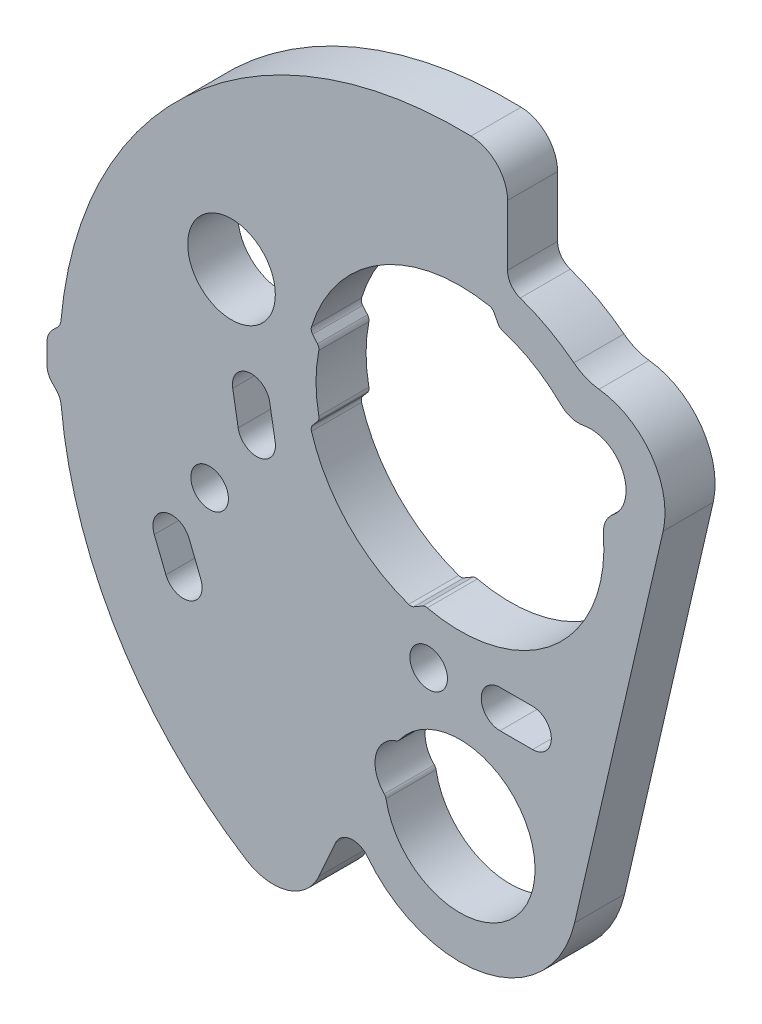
ISO-10303-21;
HEADER;
FILE_DESCRIPTION(('STEP AP214'),'2;1');
FILE_NAME('part.step','',(''),(''),'','','');
FILE_SCHEMA(('AUTOMOTIVE_DESIGN { 1 0 10303 214 1 1 1 1 }'));
ENDSEC;
DATA;
#1=APPLICATION_CONTEXT('core data for automotive mechanical design processes');
#2=APPLICATION_PROTOCOL_DEFINITION('international standard','automotive_design',2000,#1);
#3=PRODUCT_CONTEXT('',#1,'mechanical');
#4=PRODUCT('Part','Part','',(#3));
#5=PRODUCT_RELATED_PRODUCT_CATEGORY('part','',(#4));
#6=PRODUCT_DEFINITION_FORMATION('','',#4);
#7=PRODUCT_DEFINITION_CONTEXT('part definition',#1,'design');
#8=PRODUCT_DEFINITION('design','',#6,#7);
#9=PRODUCT_DEFINITION_SHAPE('','',#8);
#10=(LENGTH_UNIT() NAMED_UNIT(*) SI_UNIT(.MILLI.,.METRE.));
#11=(NAMED_UNIT(*) PLANE_ANGLE_UNIT() SI_UNIT($,.RADIAN.));
#12=(NAMED_UNIT(*) SI_UNIT($,.STERADIAN.) SOLID_ANGLE_UNIT());
#13=UNCERTAINTY_MEASURE_WITH_UNIT(LENGTH_MEASURE(1.E-05),#10,'distance_accuracy_value','');
#14=(GEOMETRIC_REPRESENTATION_CONTEXT(3) GLOBAL_UNCERTAINTY_ASSIGNED_CONTEXT((#13)) GLOBAL_UNIT_ASSIGNED_CONTEXT((#10,
#11,#12)) REPRESENTATION_CONTEXT('',''));
#15=CARTESIAN_POINT('',(0.,0.,0.));
#16=DIRECTION('',(0.,0.,1.));
#17=DIRECTION('',(1.,0.,0.));
#18=AXIS2_PLACEMENT_3D('',#15,#16,#17);
#19=CARTESIAN_POINT('',(0.8,28.9889634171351,-4.));
#20=DIRECTION('',(0.,0.,1.));
#21=DIRECTION('',(1.,0.,0.));
#22=AXIS2_PLACEMENT_3D('',#19,#20,#21);
#23=CYLINDRICAL_SURFACE('',#22,3.);
#24=CARTESIAN_POINT('',(0.8,28.9889634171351,0.));
#25=DIRECTION('',(0.,0.,1.));
#26=DIRECTION('',(1.,0.,0.));
#27=AXIS2_PLACEMENT_3D('',#24,#25,#26);
#28=CIRCLE('',#27,3.);
#29=CARTESIAN_POINT('',(3.8,28.9889634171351,0.));
#30=VERTEX_POINT('',#29);
#31=CARTESIAN_POINT('',(0.882758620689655,31.9878217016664,0.));
#32=VERTEX_POINT('',#31);
#33=EDGE_CURVE('E700',#30,#32,#28,.T.);
#34=ORIENTED_EDGE('',*,*,#33,.F.);
#35=DIRECTION('',(0.,0.,1.));
#36=VECTOR('',#35,1.);
#37=CARTESIAN_POINT('',(3.8,28.9889634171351,-4.));
#38=LINE('',#37,#36);
#39=CARTESIAN_POINT('',(3.8,28.9889634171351,-4.));
#40=VERTEX_POINT('',#39);
#41=EDGE_CURVE('E11',#40,#30,#38,.T.);
#42=ORIENTED_EDGE('',*,*,#41,.F.);
#43=CARTESIAN_POINT('',(0.8,28.9889634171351,-4.));
#44=DIRECTION('',(0.,0.,1.));
#45=DIRECTION('',(1.,0.,0.));
#46=AXIS2_PLACEMENT_3D('',#43,#44,#45);
#47=CIRCLE('',#46,3.);
#48=CARTESIAN_POINT('',(0.882758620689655,31.9878217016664,-4.));
#49=VERTEX_POINT('',#48);
#50=EDGE_CURVE('E707',#40,#49,#47,.T.);
#51=ORIENTED_EDGE('',*,*,#50,.T.);
#52=DIRECTION('',(0.,0.,1.));
#53=VECTOR('',#52,1.);
#54=CARTESIAN_POINT('',(0.882758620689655,31.9878217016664,-4.));
#55=LINE('',#54,#53);
#56=EDGE_CURVE('E44',#49,#32,#55,.T.);
#57=ORIENTED_EDGE('',*,*,#56,.T.);
#58=EDGE_LOOP('',(#34,#42,#51,#57));
#59=FACE_BOUND('',#58,.T.);
#60=ADVANCED_FACE('F41',(#59),#23,.T.);
#61=CARTESIAN_POINT('',(3.8,28.9889634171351,-4.));
#62=DIRECTION('',(1.,0.,0.));
#63=DIRECTION('',(0.,1.,0.));
#64=AXIS2_PLACEMENT_3D('',#61,#62,#63);
#65=PLANE('',#64);
#66=DIRECTION('',(0.,1.,0.));
#67=VECTOR('',#66,1.);
#68=CARTESIAN_POINT('',(3.8,28.9889634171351,0.));
#69=LINE('',#68,#67);
#70=CARTESIAN_POINT('',(3.8,24.1613964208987,0.));
#71=VERTEX_POINT('',#70);
#72=EDGE_CURVE('E711',#71,#30,#69,.T.);
#73=ORIENTED_EDGE('',*,*,#72,.F.);
#74=DIRECTION('',(0.,0.,1.));
#75=VECTOR('',#74,1.);
#76=CARTESIAN_POINT('',(3.8,24.1613964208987,-4.));
#77=LINE('',#76,#75);
#78=CARTESIAN_POINT('',(3.8,24.1613964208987,-4.));
#79=VERTEX_POINT('',#78);
#80=EDGE_CURVE('E49',#79,#71,#77,.T.);
#81=ORIENTED_EDGE('',*,*,#80,.F.);
#82=DIRECTION('',(0.,1.,0.));
#83=VECTOR('',#82,1.);
#84=CARTESIAN_POINT('',(3.8,28.9889634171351,-4.));
#85=LINE('',#84,#83);
#86=EDGE_CURVE('E765',#79,#40,#85,.T.);
#87=ORIENTED_EDGE('',*,*,#86,.T.);
#88=ORIENTED_EDGE('',*,*,#41,.T.);
#89=EDGE_LOOP('',(#73,#81,#87,#88));
#90=FACE_BOUND('',#89,.T.);
#91=ADVANCED_FACE('F872',(#90),#65,.T.);
#92=CARTESIAN_POINT('',(5.3,24.1613964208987,-4.));
#93=DIRECTION('',(0.,0.,1.));
#94=DIRECTION('',(1.,0.,0.));
#95=AXIS2_PLACEMENT_3D('',#92,#93,#94);
#96=CYLINDRICAL_SURFACE('',#95,1.5);
#97=CARTESIAN_POINT('',(5.3,24.1613964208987,0.));
#98=DIRECTION('',(0.,0.,-1.));
#99=DIRECTION('',(-1.,0.,0.));
#100=AXIS2_PLACEMENT_3D('',#97,#98,#99);
#101=CIRCLE('',#100,1.5);
#102=CARTESIAN_POINT('',(4.81076923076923,22.7434213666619,0.));
#103=VERTEX_POINT('',#102);
#104=EDGE_CURVE('E821',#103,#71,#101,.T.);
#105=ORIENTED_EDGE('',*,*,#104,.F.);
#106=DIRECTION('',(0.,0.,1.));
#107=VECTOR('',#106,1.);
#108=CARTESIAN_POINT('',(4.81076923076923,22.7434213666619,-4.));
#109=LINE('',#108,#107);
#110=CARTESIAN_POINT('',(4.81076923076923,22.7434213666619,-4.));
#111=VERTEX_POINT('',#110);
#112=EDGE_CURVE('E827',#111,#103,#109,.T.);
#113=ORIENTED_EDGE('',*,*,#112,.F.);
#114=CARTESIAN_POINT('',(5.3,24.1613964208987,-4.));
#115=DIRECTION('',(0.,0.,-1.));
#116=DIRECTION('',(-1.,0.,0.));
#117=AXIS2_PLACEMENT_3D('',#114,#115,#116);
#118=CIRCLE('',#117,1.5);
#119=EDGE_CURVE('E762',#111,#79,#118,.T.);
#120=ORIENTED_EDGE('',*,*,#119,.T.);
#121=ORIENTED_EDGE('',*,*,#80,.T.);
#122=EDGE_LOOP('',(#105,#113,#120,#121));
#123=FACE_BOUND('',#122,.T.);
#124=ADVANCED_FACE('F940',(#123),#96,.F.);
#125=CARTESIAN_POINT('',(0.,8.8,-4.));
#126=DIRECTION('',(0.,0.,1.));
#127=DIRECTION('',(1.,0.,0.));
#128=AXIS2_PLACEMENT_3D('',#125,#126,#127);
#129=CYLINDRICAL_SURFACE('',#128,14.75);
#130=CARTESIAN_POINT('',(0.,8.8,0.));
#131=DIRECTION('',(0.,0.,1.));
#132=DIRECTION('',(1.,0.,0.));
#133=AXIS2_PLACEMENT_3D('',#130,#131,#132);
#134=CIRCLE('',#133,14.75);
#135=CARTESIAN_POINT('',(9.10070158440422,20.4077444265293,0.));
#136=VERTEX_POINT('',#135);
#137=EDGE_CURVE('E818',#136,#103,#134,.T.);
#138=ORIENTED_EDGE('',*,*,#137,.F.);
#139=DIRECTION('',(0.,0.,1.));
#140=VECTOR('',#139,1.);
#141=CARTESIAN_POINT('',(9.10070158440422,20.4077444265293,-4.));
#142=LINE('',#141,#140);
#143=CARTESIAN_POINT('',(9.10070158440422,20.4077444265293,-4.));
#144=VERTEX_POINT('',#143);
#145=EDGE_CURVE('E829',#144,#136,#142,.T.);
#146=ORIENTED_EDGE('',*,*,#145,.F.);
#147=CARTESIAN_POINT('',(0.,8.8,-4.));
#148=DIRECTION('',(0.,0.,1.));
#149=DIRECTION('',(1.,0.,0.));
#150=AXIS2_PLACEMENT_3D('',#147,#148,#149);
#151=CIRCLE('',#150,14.75);
#152=EDGE_CURVE('E759',#144,#111,#151,.T.);
#153=ORIENTED_EDGE('',*,*,#152,.T.);
#154=ORIENTED_EDGE('',*,*,#112,.T.);
#155=EDGE_LOOP('',(#138,#146,#153,#154));
#156=FACE_BOUND('',#155,.T.);
#157=ADVANCED_FACE('F938',(#156),#129,.T.);
#158=CARTESIAN_POINT('',(11.5686884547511,23.5556073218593,-4.));
#159=DIRECTION('',(0.,0.,1.));
#160=DIRECTION('',(1.,0.,0.));
#161=AXIS2_PLACEMENT_3D('',#158,#159,#160);
#162=CYLINDRICAL_SURFACE('',#161,4.);
#163=CARTESIAN_POINT('',(11.5686884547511,23.5556073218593,0.));
#164=DIRECTION('',(0.,0.,-1.));
#165=DIRECTION('',(-1.,0.,0.));
#166=AXIS2_PLACEMENT_3D('',#163,#164,#165);
#167=CIRCLE('',#166,4.);
#168=CARTESIAN_POINT('',(11.1084640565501,19.5821713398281,0.));
#169=VERTEX_POINT('',#168);
#170=EDGE_CURVE('E815',#169,#136,#167,.T.);
#171=ORIENTED_EDGE('',*,*,#170,.F.);
#172=DIRECTION('',(0.,0.,1.));
#173=VECTOR('',#172,1.);
#174=CARTESIAN_POINT('',(11.1084640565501,19.5821713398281,-4.));
#175=LINE('',#174,#173);
#176=CARTESIAN_POINT('',(11.1084640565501,19.5821713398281,-4.));
#177=VERTEX_POINT('',#176);
#178=EDGE_CURVE('E831',#177,#169,#175,.T.);
#179=ORIENTED_EDGE('',*,*,#178,.F.);
#180=CARTESIAN_POINT('',(11.5686884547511,23.5556073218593,-4.));
#181=DIRECTION('',(0.,0.,-1.));
#182=DIRECTION('',(-1.,0.,0.));
#183=AXIS2_PLACEMENT_3D('',#180,#181,#182);
#184=CIRCLE('',#183,4.);
#185=EDGE_CURVE('E756',#177,#144,#184,.T.);
#186=ORIENTED_EDGE('',*,*,#185,.T.);
#187=ORIENTED_EDGE('',*,*,#145,.T.);
#188=EDGE_LOOP('',(#171,#179,#186,#187));
#189=FACE_BOUND('',#188,.T.);
#190=ADVANCED_FACE('F934',(#189),#162,.F.);
#191=CARTESIAN_POINT('',(10.4225395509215,13.660110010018,-4.));
#192=DIRECTION('',(0.,0.,1.));
#193=DIRECTION('',(1.,0.,0.));
#194=AXIS2_PLACEMENT_3D('',#191,#192,#193);
#195=CYLINDRICAL_SURFACE('',#194,5.96165269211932);
#196=CARTESIAN_POINT('',(10.4225395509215,13.660110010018,0.));
#197=DIRECTION('',(0.,0.,1.));
#198=DIRECTION('',(1.,0.,0.));
#199=AXIS2_PLACEMENT_3D('',#196,#197,#198);
#200=CIRCLE('',#199,5.96165269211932);
#201=CARTESIAN_POINT('',(16.2313954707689,12.3190299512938,0.));
#202=VERTEX_POINT('',#201);
#203=EDGE_CURVE('E812',#202,#169,#200,.T.);
#204=ORIENTED_EDGE('',*,*,#203,.F.);
#205=DIRECTION('',(0.,0.,1.));
#206=VECTOR('',#205,1.);
#207=CARTESIAN_POINT('',(16.2313954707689,12.3190299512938,-4.));
#208=LINE('',#207,#206);
#209=CARTESIAN_POINT('',(16.2313954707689,12.3190299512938,-4.));
#210=VERTEX_POINT('',#209);
#211=EDGE_CURVE('E833',#210,#202,#208,.T.);
#212=ORIENTED_EDGE('',*,*,#211,.F.);
#213=CARTESIAN_POINT('',(10.4225395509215,13.660110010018,-4.));
#214=DIRECTION('',(0.,0.,1.));
#215=DIRECTION('',(1.,0.,0.));
#216=AXIS2_PLACEMENT_3D('',#213,#214,#215);
#217=CIRCLE('',#216,5.96165269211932);
#218=EDGE_CURVE('E753',#210,#177,#217,.T.);
#219=ORIENTED_EDGE('',*,*,#218,.T.);
#220=ORIENTED_EDGE('',*,*,#178,.T.);
#221=EDGE_LOOP('',(#204,#212,#219,#220));
#222=FACE_BOUND('',#221,.T.);
#223=ADVANCED_FACE('F930',(#222),#195,.T.);
#224=CARTESIAN_POINT('',(16.2313954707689,12.3190299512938,-4.));
#225=DIRECTION('',(0.974370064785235,-0.224951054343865,0.));
#226=DIRECTION('',(0.224951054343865,0.974370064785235,0.));
#227=AXIS2_PLACEMENT_3D('',#224,#225,#226);
#228=PLANE('',#227);
#229=DIRECTION('',(0.224951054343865,0.974370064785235,0.));
#230=VECTOR('',#229,1.);
#231=CARTESIAN_POINT('',(16.2313954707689,12.3190299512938,0.));
#232=LINE('',#231,#230);
#233=CARTESIAN_POINT('',(9.15907860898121,-18.3145399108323,0.));
#234=VERTEX_POINT('',#233);
#235=EDGE_CURVE('E809',#234,#202,#232,.T.);
#236=ORIENTED_EDGE('',*,*,#235,.F.);
#237=DIRECTION('',(0.,0.,1.));
#238=VECTOR('',#237,1.);
#239=CARTESIAN_POINT('',(9.15907860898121,-18.3145399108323,-4.));
#240=LINE('',#239,#238);
#241=CARTESIAN_POINT('',(9.15907860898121,-18.3145399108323,-4.));
#242=VERTEX_POINT('',#241);
#243=EDGE_CURVE('E835',#242,#234,#240,.T.);
#244=ORIENTED_EDGE('',*,*,#243,.F.);
#245=DIRECTION('',(0.224951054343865,0.974370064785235,0.));
#246=VECTOR('',#245,1.);
#247=CARTESIAN_POINT('',(16.2313954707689,12.3190299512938,-4.));
#248=LINE('',#247,#246);
#249=EDGE_CURVE('E750',#242,#210,#248,.T.);
#250=ORIENTED_EDGE('',*,*,#249,.T.);
#251=ORIENTED_EDGE('',*,*,#211,.T.);
#252=EDGE_LOOP('',(#236,#244,#250,#251));
#253=FACE_BOUND('',#252,.T.);
#254=ADVANCED_FACE('F926',(#253),#228,.T.);
#255=CARTESIAN_POINT('',(0.,-16.2,-4.));
#256=DIRECTION('',(0.,0.,1.));
#257=DIRECTION('',(1.,0.,0.));
#258=AXIS2_PLACEMENT_3D('',#255,#256,#257);
#259=CYLINDRICAL_SURFACE('',#258,9.4);
#260=CARTESIAN_POINT('',(0.,-16.2,0.));
#261=DIRECTION('',(0.,0.,1.));
#262=DIRECTION('',(1.,0.,0.));
#263=AXIS2_PLACEMENT_3D('',#260,#261,#262);
#264=CIRCLE('',#263,9.4);
#265=CARTESIAN_POINT('',(-7.39038158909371,-22.0088088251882,0.));
#266=VERTEX_POINT('',#265);
#267=EDGE_CURVE('E806',#266,#234,#264,.T.);
#268=ORIENTED_EDGE('',*,*,#267,.F.);
#269=DIRECTION('',(0.,0.,1.));
#270=VECTOR('',#269,1.);
#271=CARTESIAN_POINT('',(-7.39038158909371,-22.0088088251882,-4.));
#272=LINE('',#271,#270);
#273=CARTESIAN_POINT('',(-7.39038158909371,-22.0088088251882,-4.));
#274=VERTEX_POINT('',#273);
#275=EDGE_CURVE('E837',#274,#266,#272,.T.);
#276=ORIENTED_EDGE('',*,*,#275,.F.);
#277=CARTESIAN_POINT('',(0.,-16.2,-4.));
#278=DIRECTION('',(0.,0.,1.));
#279=DIRECTION('',(1.,0.,0.));
#280=AXIS2_PLACEMENT_3D('',#277,#278,#279);
#281=CIRCLE('',#280,9.4);
#282=EDGE_CURVE('E747',#274,#242,#281,.T.);
#283=ORIENTED_EDGE('',*,*,#282,.T.);
#284=ORIENTED_EDGE('',*,*,#243,.T.);
#285=EDGE_LOOP('',(#268,#276,#283,#284));
#286=FACE_BOUND('',#285,.T.);
#287=ADVANCED_FACE('F922',(#286),#259,.T.);
#288=CARTESIAN_POINT('',(-8.56969780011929,-22.9357464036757,-4.));
#289=DIRECTION('',(0.,0.,1.));
#290=DIRECTION('',(1.,0.,0.));
#291=AXIS2_PLACEMENT_3D('',#288,#289,#290);
#292=CYLINDRICAL_SURFACE('',#291,1.5);
#293=CARTESIAN_POINT('',(-8.56969780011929,-22.9357464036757,0.));
#294=DIRECTION('',(0.,0.,-1.));
#295=DIRECTION('',(1.,0.,0.));
#296=AXIS2_PLACEMENT_3D('',#293,#294,#295);
#297=CIRCLE('',#296,1.5);
#298=CARTESIAN_POINT('',(-9.94001598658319,-22.325641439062,0.));
#299=VERTEX_POINT('',#298);
#300=EDGE_CURVE('E803',#299,#266,#297,.T.);
#301=ORIENTED_EDGE('',*,*,#300,.F.);
#302=DIRECTION('',(0.,0.,1.));
#303=VECTOR('',#302,1.);
#304=CARTESIAN_POINT('',(-9.94001598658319,-22.325641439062,-4.));
#305=LINE('',#304,#303);
#306=CARTESIAN_POINT('',(-9.94001598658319,-22.325641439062,-4.));
#307=VERTEX_POINT('',#306);
#308=EDGE_CURVE('E839',#307,#299,#305,.T.);
#309=ORIENTED_EDGE('',*,*,#308,.F.);
#310=CARTESIAN_POINT('',(-8.56969780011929,-22.9357464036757,-4.));
#311=DIRECTION('',(0.,0.,-1.));
#312=DIRECTION('',(1.,0.,0.));
#313=AXIS2_PLACEMENT_3D('',#310,#311,#312);
#314=CIRCLE('',#313,1.5);
#315=EDGE_CURVE('E744',#307,#274,#314,.T.);
#316=ORIENTED_EDGE('',*,*,#315,.T.);
#317=ORIENTED_EDGE('',*,*,#275,.T.);
#318=EDGE_LOOP('',(#301,#309,#316,#317));
#319=FACE_BOUND('',#318,.T.);
#320=ADVANCED_FACE('F918',(#319),#292,.F.);
#321=CARTESIAN_POINT('',(-11.2718164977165,-25.316914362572,-4.));
#322=DIRECTION('',(0.913545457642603,-0.406736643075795,0.));
#323=DIRECTION('',(0.406736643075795,0.913545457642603,0.));
#324=AXIS2_PLACEMENT_3D('',#321,#322,#323);
#325=PLANE('',#324);
#326=DIRECTION('',(0.406736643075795,0.913545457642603,0.));
#327=VECTOR('',#326,1.);
#328=CARTESIAN_POINT('',(-11.2718164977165,-25.316914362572,0.));
#329=LINE('',#328,#327);
#330=CARTESIAN_POINT('',(-11.2718164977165,-25.316914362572,0.));
#331=VERTEX_POINT('',#330);
#332=EDGE_CURVE('E800',#331,#299,#329,.T.);
#333=ORIENTED_EDGE('',*,*,#332,.F.);
#334=DIRECTION('',(0.,0.,1.));
#335=VECTOR('',#334,1.);
#336=CARTESIAN_POINT('',(-11.2718164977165,-25.316914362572,-4.));
#337=LINE('',#336,#335);
#338=CARTESIAN_POINT('',(-11.2718164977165,-25.316914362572,-4.));
#339=VERTEX_POINT('',#338);
#340=EDGE_CURVE('E841',#339,#331,#337,.T.);
#341=ORIENTED_EDGE('',*,*,#340,.F.);
#342=DIRECTION('',(0.406736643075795,0.913545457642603,0.));
#343=VECTOR('',#342,1.);
#344=CARTESIAN_POINT('',(-11.2718164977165,-25.316914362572,-4.));
#345=LINE('',#344,#343);
#346=EDGE_CURVE('E741',#339,#307,#345,.T.);
#347=ORIENTED_EDGE('',*,*,#346,.T.);
#348=ORIENTED_EDGE('',*,*,#308,.T.);
#349=EDGE_LOOP('',(#333,#341,#347,#348));
#350=FACE_BOUND('',#349,.T.);
#351=ADVANCED_FACE('F914',(#350),#325,.T.);
#352=CARTESIAN_POINT('',(-14.925998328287,-23.6899677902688,-4.));
#353=DIRECTION('',(0.,0.,1.));
#354=DIRECTION('',(1.,0.,0.));
#355=AXIS2_PLACEMENT_3D('',#352,#353,#354);
#356=CYLINDRICAL_SURFACE('',#355,4.);
#357=CARTESIAN_POINT('',(-14.925998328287,-23.6899677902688,0.));
#358=DIRECTION('',(0.,0.,1.));
#359=DIRECTION('',(-1.,0.,0.));
#360=AXIS2_PLACEMENT_3D('',#357,#358,#359);
#361=CIRCLE('',#360,4.);
#362=CARTESIAN_POINT('',(-17.0582838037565,-27.0742489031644,0.));
#363=VERTEX_POINT('',#362);
#364=EDGE_CURVE('E797',#363,#331,#361,.T.);
#365=ORIENTED_EDGE('',*,*,#364,.F.);
#366=DIRECTION('',(0.,0.,1.));
#367=VECTOR('',#366,1.);
#368=CARTESIAN_POINT('',(-17.0582838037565,-27.0742489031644,-4.));
#369=LINE('',#368,#367);
#370=CARTESIAN_POINT('',(-17.0582838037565,-27.0742489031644,-4.));
#371=VERTEX_POINT('',#370);
#372=EDGE_CURVE('E843',#371,#363,#369,.T.);
#373=ORIENTED_EDGE('',*,*,#372,.F.);
#374=CARTESIAN_POINT('',(-14.925998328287,-23.6899677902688,-4.));
#375=DIRECTION('',(0.,0.,1.));
#376=DIRECTION('',(-1.,0.,0.));
#377=AXIS2_PLACEMENT_3D('',#374,#375,#376);
#378=CIRCLE('',#377,4.);
#379=EDGE_CURVE('E738',#371,#339,#378,.T.);
#380=ORIENTED_EDGE('',*,*,#379,.T.);
#381=ORIENTED_EDGE('',*,*,#340,.T.);
#382=EDGE_LOOP('',(#365,#373,#380,#381));
#383=FACE_BOUND('',#382,.T.);
#384=ADVANCED_FACE('F910',(#383),#356,.T.);
#385=CARTESIAN_POINT('',(0.,0.,-4.));
#386=DIRECTION('',(0.,0.,1.));
#387=DIRECTION('',(1.,0.,0.));
#388=AXIS2_PLACEMENT_3D('',#385,#386,#387);
#389=CYLINDRICAL_SURFACE('',#388,32.);
#390=CARTESIAN_POINT('',(0.,0.,0.));
#391=DIRECTION('',(0.,0.,1.));
#392=DIRECTION('',(1.,0.,0.));
#393=AXIS2_PLACEMENT_3D('',#390,#391,#392);
#394=CIRCLE('',#393,32.);
#395=CARTESIAN_POINT('',(-31.8563453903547,-3.02873874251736,0.));
#396=VERTEX_POINT('',#395);
#397=EDGE_CURVE('E794',#396,#363,#394,.T.);
#398=ORIENTED_EDGE('',*,*,#397,.F.);
#399=DIRECTION('',(0.,0.,1.));
#400=VECTOR('',#399,1.);
#401=CARTESIAN_POINT('',(-31.8563453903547,-3.02873874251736,-4.));
#402=LINE('',#401,#400);
#403=CARTESIAN_POINT('',(-31.8563453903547,-3.02873874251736,-4.));
#404=VERTEX_POINT('',#403);
#405=EDGE_CURVE('E845',#404,#396,#402,.T.);
#406=ORIENTED_EDGE('',*,*,#405,.F.);
#407=CARTESIAN_POINT('',(0.,0.,-4.));
#408=DIRECTION('',(0.,0.,1.));
#409=DIRECTION('',(1.,0.,0.));
#410=AXIS2_PLACEMENT_3D('',#407,#408,#409);
#411=CIRCLE('',#410,32.);
#412=EDGE_CURVE('E735',#404,#371,#411,.T.);
#413=ORIENTED_EDGE('',*,*,#412,.T.);
#414=ORIENTED_EDGE('',*,*,#372,.T.);
#415=EDGE_LOOP('',(#398,#406,#413,#414));
#416=FACE_BOUND('',#415,.T.);
#417=ADVANCED_FACE('F906',(#416),#389,.T.);
#418=CARTESIAN_POINT('',(-33.3496115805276,-3.17071087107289,-4.));
#419=DIRECTION('',(0.,0.,1.));
#420=DIRECTION('',(1.,0.,0.));
#421=AXIS2_PLACEMENT_3D('',#418,#419,#420);
#422=CYLINDRICAL_SURFACE('',#421,1.5);
#423=CARTESIAN_POINT('',(-33.3496115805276,-3.17071087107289,0.));
#424=DIRECTION('',(0.,0.,-1.));
#425=DIRECTION('',(1.,0.,0.));
#426=AXIS2_PLACEMENT_3D('',#423,#424,#425);
#427=CIRCLE('',#426,1.5);
#428=CARTESIAN_POINT('',(-32.2889514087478,-2.11005069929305,0.));
#429=VERTEX_POINT('',#428);
#430=EDGE_CURVE('E791',#429,#396,#427,.T.);
#431=ORIENTED_EDGE('',*,*,#430,.F.);
#432=DIRECTION('',(0.,0.,1.));
#433=VECTOR('',#432,1.);
#434=CARTESIAN_POINT('',(-32.2889514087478,-2.11005069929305,-4.));
#435=LINE('',#434,#433);
#436=CARTESIAN_POINT('',(-32.2889514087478,-2.11005069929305,-4.));
#437=VERTEX_POINT('',#436);
#438=EDGE_CURVE('E847',#437,#429,#435,.T.);
#439=ORIENTED_EDGE('',*,*,#438,.F.);
#440=CARTESIAN_POINT('',(-33.3496115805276,-3.17071087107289,-4.));
#441=DIRECTION('',(0.,0.,-1.));
#442=DIRECTION('',(1.,0.,0.));
#443=AXIS2_PLACEMENT_3D('',#440,#441,#442);
#444=CIRCLE('',#443,1.5);
#445=EDGE_CURVE('E732',#437,#404,#444,.T.);
#446=ORIENTED_EDGE('',*,*,#445,.T.);
#447=ORIENTED_EDGE('',*,*,#405,.T.);
#448=EDGE_LOOP('',(#431,#439,#446,#447));
#449=FACE_BOUND('',#448,.T.);
#450=ADVANCED_FACE('F902',(#449),#422,.F.);
#451=CARTESIAN_POINT('',(-32.5508141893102,-1.84818791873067,-4.));
#452=DIRECTION('',(-0.707106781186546,-0.707106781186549,0.));
#453=DIRECTION('',(0.707106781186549,-0.707106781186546,0.));
#454=AXIS2_PLACEMENT_3D('',#451,#452,#453);
#455=PLANE('',#454);
#456=DIRECTION('',(0.707106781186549,-0.707106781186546,0.));
#457=VECTOR('',#456,1.);
#458=CARTESIAN_POINT('',(-32.5508141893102,-1.84818791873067,0.));
#459=LINE('',#458,#457);
#460=CARTESIAN_POINT('',(-32.5508141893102,-1.84818791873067,0.));
#461=VERTEX_POINT('',#460);
#462=EDGE_CURVE('E788',#461,#429,#459,.T.);
#463=ORIENTED_EDGE('',*,*,#462,.F.);
#464=DIRECTION('',(0.,0.,1.));
#465=VECTOR('',#464,1.);
#466=CARTESIAN_POINT('',(-32.5508141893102,-1.84818791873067,-4.));
#467=LINE('',#466,#465);
#468=CARTESIAN_POINT('',(-32.5508141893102,-1.84818791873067,-4.));
#469=VERTEX_POINT('',#468);
#470=EDGE_CURVE('E849',#469,#461,#467,.T.);
#471=ORIENTED_EDGE('',*,*,#470,.F.);
#472=DIRECTION('',(0.707106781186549,-0.707106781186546,0.));
#473=VECTOR('',#472,1.);
#474=CARTESIAN_POINT('',(-32.5508141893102,-1.84818791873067,-4.));
#475=LINE('',#474,#473);
#476=EDGE_CURVE('E729',#469,#437,#475,.T.);
#477=ORIENTED_EDGE('',*,*,#476,.T.);
#478=ORIENTED_EDGE('',*,*,#438,.T.);
#479=EDGE_LOOP('',(#463,#471,#477,#478));
#480=FACE_BOUND('',#479,.T.);
#481=ADVANCED_FACE('F898',(#480),#455,.T.);
#482=CARTESIAN_POINT('',(-31.4901540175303,-0.787527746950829,-4.));
#483=DIRECTION('',(0.,0.,1.));
#484=DIRECTION('',(1.,0.,0.));
#485=AXIS2_PLACEMENT_3D('',#482,#483,#484);
#486=CYLINDRICAL_SURFACE('',#485,1.5);
#487=CARTESIAN_POINT('',(-31.4901540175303,-0.787527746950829,0.));
#488=DIRECTION('',(0.,0.,1.));
#489=DIRECTION('',(-1.,0.,0.));
#490=AXIS2_PLACEMENT_3D('',#487,#488,#489);
#491=CIRCLE('',#490,1.5);
#492=CARTESIAN_POINT('',(-32.9896851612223,-0.825029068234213,0.));
#493=VERTEX_POINT('',#492);
#494=EDGE_CURVE('E785',#493,#461,#491,.T.);
#495=ORIENTED_EDGE('',*,*,#494,.F.);
#496=DIRECTION('',(0.,0.,1.));
#497=VECTOR('',#496,1.);
#498=CARTESIAN_POINT('',(-32.9896851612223,-0.825029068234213,-4.));
#499=LINE('',#498,#497);
#500=CARTESIAN_POINT('',(-32.9896851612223,-0.825029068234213,-4.));
#501=VERTEX_POINT('',#500);
#502=EDGE_CURVE('E851',#501,#493,#499,.T.);
#503=ORIENTED_EDGE('',*,*,#502,.F.);
#504=CARTESIAN_POINT('',(-31.4901540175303,-0.787527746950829,-4.));
#505=DIRECTION('',(0.,0.,1.));
#506=DIRECTION('',(-1.,0.,0.));
#507=AXIS2_PLACEMENT_3D('',#504,#505,#506);
#508=CIRCLE('',#507,1.5);
#509=EDGE_CURVE('E726',#501,#469,#508,.T.);
#510=ORIENTED_EDGE('',*,*,#509,.T.);
#511=ORIENTED_EDGE('',*,*,#470,.T.);
#512=EDGE_LOOP('',(#495,#503,#510,#511));
#513=FACE_BOUND('',#512,.T.);
#514=ADVANCED_FACE('F894',(#513),#486,.T.);
#515=CARTESIAN_POINT('',(0.,0.,-4.));
#516=DIRECTION('',(0.,0.,1.));
#517=DIRECTION('',(1.,0.,0.));
#518=AXIS2_PLACEMENT_3D('',#515,#516,#517);
#519=CYLINDRICAL_SURFACE('',#518,33.);
#520=CARTESIAN_POINT('',(0.,0.,0.));
#521=DIRECTION('',(0.,0.,1.));
#522=DIRECTION('',(1.,0.,0.));
#523=AXIS2_PLACEMENT_3D('',#520,#521,#522);
#524=CIRCLE('',#523,33.);
#525=CARTESIAN_POINT('',(-32.9896851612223,0.825029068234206,0.));
#526=VERTEX_POINT('',#525);
#527=EDGE_CURVE('E782',#526,#493,#524,.T.);
#528=ORIENTED_EDGE('',*,*,#527,.F.);
#529=DIRECTION('',(0.,0.,1.));
#530=VECTOR('',#529,1.);
#531=CARTESIAN_POINT('',(-32.9896851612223,0.825029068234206,-4.));
#532=LINE('',#531,#530);
#533=CARTESIAN_POINT('',(-32.9896851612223,0.825029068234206,-4.));
#534=VERTEX_POINT('',#533);
#535=EDGE_CURVE('E853',#534,#526,#532,.T.);
#536=ORIENTED_EDGE('',*,*,#535,.F.);
#537=CARTESIAN_POINT('',(0.,0.,-4.));
#538=DIRECTION('',(0.,0.,1.));
#539=DIRECTION('',(1.,0.,0.));
#540=AXIS2_PLACEMENT_3D('',#537,#538,#539);
#541=CIRCLE('',#540,33.);
#542=EDGE_CURVE('E723',#534,#501,#541,.T.);
#543=ORIENTED_EDGE('',*,*,#542,.T.);
#544=ORIENTED_EDGE('',*,*,#502,.T.);
#545=EDGE_LOOP('',(#528,#536,#543,#544));
#546=FACE_BOUND('',#545,.T.);
#547=ADVANCED_FACE('F890',(#546),#519,.T.);
#548=CARTESIAN_POINT('',(-31.4901540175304,0.78752774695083,-4.));
#549=DIRECTION('',(0.,0.,1.));
#550=DIRECTION('',(1.,0.,0.));
#551=AXIS2_PLACEMENT_3D('',#548,#549,#550);
#552=CYLINDRICAL_SURFACE('',#551,1.49999999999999);
#553=CARTESIAN_POINT('',(-31.4901540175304,0.78752774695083,0.));
#554=DIRECTION('',(0.,0.,1.));
#555=DIRECTION('',(1.,0.,0.));
#556=AXIS2_PLACEMENT_3D('',#553,#554,#555);
#557=CIRCLE('',#556,1.49999999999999);
#558=CARTESIAN_POINT('',(-32.5508141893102,1.84818791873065,0.));
#559=VERTEX_POINT('',#558);
#560=EDGE_CURVE('E779',#559,#526,#557,.T.);
#561=ORIENTED_EDGE('',*,*,#560,.F.);
#562=DIRECTION('',(0.,0.,1.));
#563=VECTOR('',#562,1.);
#564=CARTESIAN_POINT('',(-32.5508141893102,1.84818791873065,-4.));
#565=LINE('',#564,#563);
#566=CARTESIAN_POINT('',(-32.5508141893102,1.84818791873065,-4.));
#567=VERTEX_POINT('',#566);
#568=EDGE_CURVE('E855',#567,#559,#565,.T.);
#569=ORIENTED_EDGE('',*,*,#568,.F.);
#570=CARTESIAN_POINT('',(-31.4901540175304,0.78752774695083,-4.));
#571=DIRECTION('',(0.,0.,1.));
#572=DIRECTION('',(1.,0.,0.));
#573=AXIS2_PLACEMENT_3D('',#570,#571,#572);
#574=CIRCLE('',#573,1.49999999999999);
#575=EDGE_CURVE('E720',#567,#534,#574,.T.);
#576=ORIENTED_EDGE('',*,*,#575,.T.);
#577=ORIENTED_EDGE('',*,*,#535,.T.);
#578=EDGE_LOOP('',(#561,#569,#576,#577));
#579=FACE_BOUND('',#578,.T.);
#580=ADVANCED_FACE('F886',(#579),#552,.T.);
#581=CARTESIAN_POINT('',(-32.5508141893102,1.84818791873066,-4.));
#582=DIRECTION('',(-0.707106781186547,0.707106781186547,0.));
#583=DIRECTION('',(-0.707106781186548,-0.707106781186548,0.));
#584=AXIS2_PLACEMENT_3D('',#581,#582,#583);
#585=PLANE('',#584);
#586=DIRECTION('',(-0.707106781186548,-0.707106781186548,0.));
#587=VECTOR('',#586,1.);
#588=CARTESIAN_POINT('',(-32.5508141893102,1.84818791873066,0.));
#589=LINE('',#588,#587);
#590=CARTESIAN_POINT('',(-32.1612320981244,2.23777000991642,0.));
#591=VERTEX_POINT('',#590);
#592=EDGE_CURVE('E776',#591,#559,#589,.T.);
#593=ORIENTED_EDGE('',*,*,#592,.F.);
#594=DIRECTION('',(0.,0.,1.));
#595=VECTOR('',#594,1.);
#596=CARTESIAN_POINT('',(-32.1612320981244,2.23777000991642,-4.));
#597=LINE('',#596,#595);
#598=CARTESIAN_POINT('',(-32.1612320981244,2.23777000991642,-4.));
#599=VERTEX_POINT('',#598);
#600=EDGE_CURVE('E857',#599,#591,#597,.T.);
#601=ORIENTED_EDGE('',*,*,#600,.F.);
#602=DIRECTION('',(-0.707106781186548,-0.707106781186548,0.));
#603=VECTOR('',#602,1.);
#604=CARTESIAN_POINT('',(-32.5508141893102,1.84818791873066,-4.));
#605=LINE('',#604,#603);
#606=EDGE_CURVE('E717',#599,#567,#605,.T.);
#607=ORIENTED_EDGE('',*,*,#606,.T.);
#608=ORIENTED_EDGE('',*,*,#568,.T.);
#609=EDGE_LOOP('',(#593,#601,#607,#608));
#610=FACE_BOUND('',#609,.T.);
#611=ADVANCED_FACE('F884',(#610),#585,.T.);
#612=CARTESIAN_POINT('',(-32.8683388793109,2.94487679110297,-4.));
#613=DIRECTION('',(0.,0.,1.));
#614=DIRECTION('',(1.,0.,0.));
#615=AXIS2_PLACEMENT_3D('',#612,#613,#614);
#616=CYLINDRICAL_SURFACE('',#615,0.999999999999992);
#617=CARTESIAN_POINT('',(-32.8683388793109,2.94487679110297,0.));
#618=DIRECTION('',(0.,0.,-1.));
#619=DIRECTION('',(-1.,0.,0.));
#620=AXIS2_PLACEMENT_3D('',#617,#618,#619);
#621=CIRCLE('',#620,0.999999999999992);
#622=CARTESIAN_POINT('',(-31.8723286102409,2.85563810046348,0.));
#623=VERTEX_POINT('',#622);
#624=EDGE_CURVE('E773',#623,#591,#621,.T.);
#625=ORIENTED_EDGE('',*,*,#624,.F.);
#626=DIRECTION('',(0.,0.,1.));
#627=VECTOR('',#626,1.);
#628=CARTESIAN_POINT('',(-31.8723286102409,2.85563810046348,-4.));
#629=LINE('',#628,#627);
#630=CARTESIAN_POINT('',(-31.8723286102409,2.85563810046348,-4.));
#631=VERTEX_POINT('',#630);
#632=EDGE_CURVE('E858',#631,#623,#629,.T.);
#633=ORIENTED_EDGE('',*,*,#632,.F.);
#634=CARTESIAN_POINT('',(-32.8683388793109,2.94487679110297,-4.));
#635=DIRECTION('',(0.,0.,-1.));
#636=DIRECTION('',(-1.,0.,0.));
#637=AXIS2_PLACEMENT_3D('',#634,#635,#636);
#638=CIRCLE('',#637,0.999999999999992);
#639=EDGE_CURVE('E714',#631,#599,#638,.T.);
#640=ORIENTED_EDGE('',*,*,#639,.T.);
#641=ORIENTED_EDGE('',*,*,#600,.T.);
#642=EDGE_LOOP('',(#625,#633,#640,#641));
#643=FACE_BOUND('',#642,.T.);
#644=ADVANCED_FACE('F880',(#643),#616,.F.);
#645=CARTESIAN_POINT('',(0.,0.,-4.));
#646=DIRECTION('',(0.,0.,1.));
#647=DIRECTION('',(1.,0.,0.));
#648=AXIS2_PLACEMENT_3D('',#645,#646,#647);
#649=CYLINDRICAL_SURFACE('',#648,32.);
#650=CARTESIAN_POINT('',(0.,0.,0.));
#651=DIRECTION('',(0.,0.,1.));
#652=DIRECTION('',(1.,0.,0.));
#653=AXIS2_PLACEMENT_3D('',#650,#651,#652);
#654=CIRCLE('',#653,32.);
#655=EDGE_CURVE('E770',#32,#623,#654,.T.);
#656=ORIENTED_EDGE('',*,*,#655,.F.);
#657=ORIENTED_EDGE('',*,*,#56,.F.);
#658=CARTESIAN_POINT('',(0.,0.,-4.));
#659=DIRECTION('',(0.,0.,1.));
#660=DIRECTION('',(1.,0.,0.));
#661=AXIS2_PLACEMENT_3D('',#658,#659,#660);
#662=CIRCLE('',#661,32.);
#663=EDGE_CURVE('E710',#49,#631,#662,.T.);
#664=ORIENTED_EDGE('',*,*,#663,.T.);
#665=ORIENTED_EDGE('',*,*,#632,.T.);
#666=EDGE_LOOP('',(#656,#657,#664,#665));
#667=FACE_BOUND('',#666,.T.);
#668=ADVANCED_FACE('F866',(#667),#649,.T.);
#669=CARTESIAN_POINT('',(0.8,28.9889634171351,-4.));
#670=DIRECTION('',(0.,0.,1.));
#671=DIRECTION('',(1.,0.,0.));
#672=AXIS2_PLACEMENT_3D('',#669,#670,#671);
#673=PLANE('',#672);
#674=DIRECTION('',(-1.,0.,0.));
#675=VECTOR('',#674,1.);
#676=CARTESIAN_POINT('',(3.2,-5.,-4.));
#677=LINE('',#676,#675);
#678=CARTESIAN_POINT('',(5.8,-5.,-4.));
#679=VERTEX_POINT('',#678);
#680=CARTESIAN_POINT('',(3.2,-5.,-4.));
#681=VERTEX_POINT('',#680);
#682=EDGE_CURVE('E406',#679,#681,#677,.T.);
#683=ORIENTED_EDGE('',*,*,#682,.T.);
#684=CARTESIAN_POINT('',(3.2,-6.5,-4.));
#685=DIRECTION('',(0.,0.,1.));
#686=DIRECTION('',(1.,0.,0.));
#687=AXIS2_PLACEMENT_3D('',#684,#685,#686);
#688=CIRCLE('',#687,1.5);
#689=CARTESIAN_POINT('',(3.2,-8.,-4.));
#690=VERTEX_POINT('',#689);
#691=EDGE_CURVE('E398',#681,#690,#688,.T.);
#692=ORIENTED_EDGE('',*,*,#691,.T.);
#693=DIRECTION('',(1.,0.,0.));
#694=VECTOR('',#693,1.);
#695=CARTESIAN_POINT('',(3.2,-8.,-4.));
#696=LINE('',#695,#694);
#697=CARTESIAN_POINT('',(5.8,-8.,-4.));
#698=VERTEX_POINT('',#697);
#699=EDGE_CURVE('E409',#690,#698,#696,.T.);
#700=ORIENTED_EDGE('',*,*,#699,.T.);
#701=CARTESIAN_POINT('',(5.8,-6.5,-4.));
#702=DIRECTION('',(0.,0.,1.));
#703=DIRECTION('',(1.,0.,0.));
#704=AXIS2_PLACEMENT_3D('',#701,#702,#703);
#705=CIRCLE('',#704,1.5);
#706=EDGE_CURVE('E57',#698,#679,#705,.T.);
#707=ORIENTED_EDGE('',*,*,#706,.T.);
#708=EDGE_LOOP('',(#683,#692,#700,#707));
#709=FACE_BOUND('',#708,.T.);
#710=CARTESIAN_POINT('',(-2.5,-6.5,-4.));
#711=DIRECTION('',(0.,0.,1.));
#712=DIRECTION('',(1.,0.,0.));
#713=AXIS2_PLACEMENT_3D('',#710,#711,#712);
#714=CIRCLE('',#713,1.5);
#715=CARTESIAN_POINT('',(-0.999999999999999,-6.5,-4.));
#716=VERTEX_POINT('',#715);
#717=EDGE_CURVE('E438',#716,#716,#714,.T.);
#718=ORIENTED_EDGE('',*,*,#717,.T.);
#719=EDGE_LOOP('',(#718));
#720=FACE_BOUND('',#719,.T.);
#721=DIRECTION('',(0.170209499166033,-0.98540789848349,0.));
#722=VECTOR('',#721,1.);
#723=CARTESIAN_POINT('',(-17.7181118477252,2.49468575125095,-4.));
#724=LINE('',#723,#722);
#725=CARTESIAN_POINT('',(-18.1538481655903,5.01732997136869,-4.));
#726=VERTEX_POINT('',#725);
#727=CARTESIAN_POINT('',(-17.7181118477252,2.49468575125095,-4.));
#728=VERTEX_POINT('',#727);
#729=EDGE_CURVE('E445',#726,#728,#724,.T.);
#730=ORIENTED_EDGE('',*,*,#729,.T.);
#731=CARTESIAN_POINT('',(-16.24,2.75,-4.));
#732=DIRECTION('',(0.,0.,1.));
#733=DIRECTION('',(1.,0.,0.));
#734=AXIS2_PLACEMENT_3D('',#731,#732,#733);
#735=CIRCLE('',#734,1.5);
#736=CARTESIAN_POINT('',(-14.7618881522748,3.00531424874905,-4.));
#737=VERTEX_POINT('',#736);
#738=EDGE_CURVE('E457',#728,#737,#735,.T.);
#739=ORIENTED_EDGE('',*,*,#738,.T.);
#740=DIRECTION('',(-0.170209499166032,0.98540789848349,0.));
#741=VECTOR('',#740,1.);
#742=CARTESIAN_POINT('',(-14.7618881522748,3.00531424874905,-4.));
#743=LINE('',#742,#741);
#744=CARTESIAN_POINT('',(-15.1976244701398,5.52795846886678,-4.));
#745=VERTEX_POINT('',#744);
#746=EDGE_CURVE('E467',#737,#745,#743,.T.);
#747=ORIENTED_EDGE('',*,*,#746,.T.);
#748=CARTESIAN_POINT('',(-16.675736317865,5.27264422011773,-4.));
#749=DIRECTION('',(0.,0.,1.));
#750=DIRECTION('',(1.,0.,0.));
#751=AXIS2_PLACEMENT_3D('',#748,#749,#750);
#752=CIRCLE('',#751,1.5);
#753=EDGE_CURVE('E65',#745,#726,#752,.T.);
#754=ORIENTED_EDGE('',*,*,#753,.T.);
#755=EDGE_LOOP('',(#730,#739,#747,#754));
#756=FACE_BOUND('',#755,.T.);
#757=CARTESIAN_POINT('',(-20.,-2.8,-4.));
#758=DIRECTION('',(0.,0.,1.));
#759=DIRECTION('',(1.,0.,0.));
#760=AXIS2_PLACEMENT_3D('',#757,#758,#759);
#761=CIRCLE('',#760,1.5);
#762=CARTESIAN_POINT('',(-18.5,-2.8,-4.));
#763=VERTEX_POINT('',#762);
#764=EDGE_CURVE('E474',#763,#763,#761,.T.);
#765=ORIENTED_EDGE('',*,*,#764,.T.);
#766=EDGE_LOOP('',(#765));
#767=FACE_BOUND('',#766,.T.);
#768=DIRECTION('',(-0.371367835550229,0.928485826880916,0.));
#769=VECTOR('',#768,1.);
#770=CARTESIAN_POINT('',(-21.6356908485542,-7.12173367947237,-4.));
#771=LINE('',#770,#769);
#772=CARTESIAN_POINT('',(-20.7072712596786,-9.44294824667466,-4.));
#773=VERTEX_POINT('',#772);
#774=CARTESIAN_POINT('',(-21.6356908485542,-7.12173367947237,-4.));
#775=VERTEX_POINT('',#774);
#776=EDGE_CURVE('E481',#773,#775,#771,.T.);
#777=ORIENTED_EDGE('',*,*,#776,.T.);
#778=CARTESIAN_POINT('',(-23.0284195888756,-7.67878543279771,-4.));
#779=DIRECTION('',(0.,0.,1.));
#780=DIRECTION('',(1.,0.,0.));
#781=AXIS2_PLACEMENT_3D('',#778,#779,#780);
#782=CIRCLE('',#781,1.5);
#783=CARTESIAN_POINT('',(-24.4211483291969,-8.23583718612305,-4.));
#784=VERTEX_POINT('',#783);
#785=EDGE_CURVE('E493',#775,#784,#782,.T.);
#786=ORIENTED_EDGE('',*,*,#785,.T.);
#787=DIRECTION('',(0.371367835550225,-0.928485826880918,0.));
#788=VECTOR('',#787,1.);
#789=CARTESIAN_POINT('',(-24.4211483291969,-8.23583718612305,-4.));
#790=LINE('',#789,#788);
#791=CARTESIAN_POINT('',(-23.4927287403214,-10.5570517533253,-4.));
#792=VERTEX_POINT('',#791);
#793=EDGE_CURVE('E505',#784,#792,#790,.T.);
#794=ORIENTED_EDGE('',*,*,#793,.T.);
#795=CARTESIAN_POINT('',(-22.1,-10.,-4.));
#796=DIRECTION('',(0.,0.,1.));
#797=DIRECTION('',(1.,0.,0.));
#798=AXIS2_PLACEMENT_3D('',#795,#796,#797);
#799=CIRCLE('',#798,1.5);
#800=EDGE_CURVE('E502',#792,#773,#799,.T.);
#801=ORIENTED_EDGE('',*,*,#800,.T.);
#802=EDGE_LOOP('',(#777,#786,#794,#801));
#803=FACE_BOUND('',#802,.T.);
#804=CARTESIAN_POINT('',(-18.25,13.2,-4.));
#805=DIRECTION('',(0.,0.,1.));
#806=DIRECTION('',(1.,0.,0.));
#807=AXIS2_PLACEMENT_3D('',#804,#805,#806);
#808=CIRCLE('',#807,3.5);
#809=CARTESIAN_POINT('',(-14.75,13.2,-4.));
#810=VERTEX_POINT('',#809);
#811=EDGE_CURVE('E512',#810,#810,#808,.T.);
#812=ORIENTED_EDGE('',*,*,#811,.T.);
#813=EDGE_LOOP('',(#812));
#814=FACE_BOUND('',#813,.T.);
#815=CARTESIAN_POINT('',(0.,8.8,-4.));
#816=DIRECTION('',(0.,0.,1.));
#817=DIRECTION('',(1.,0.,0.));
#818=AXIS2_PLACEMENT_3D('',#815,#816,#817);
#819=CIRCLE('',#818,11.5);
#820=CARTESIAN_POINT('',(-2.60972232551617,-2.39997095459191,-4.));
#821=VERTEX_POINT('',#820);
#822=CARTESIAN_POINT('',(11.4633694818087,9.71714781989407,-4.));
#823=VERTEX_POINT('',#822);
#824=EDGE_CURVE('E573',#821,#823,#819,.T.);
#825=ORIENTED_EDGE('',*,*,#824,.T.);
#826=CARTESIAN_POINT('',(13.4569989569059,9.8766517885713,-4.));
#827=DIRECTION('',(0.,0.,-1.));
#828=DIRECTION('',(1.,0.,0.));
#829=AXIS2_PLACEMENT_3D('',#826,#827,#828);
#830=CIRCLE('',#829,2.);
#831=CARTESIAN_POINT('',(12.2056754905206,11.4368407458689,-4.));
#832=VERTEX_POINT('',#831);
#833=EDGE_CURVE('E515',#823,#832,#830,.T.);
#834=ORIENTED_EDGE('',*,*,#833,.T.);
#835=CARTESIAN_POINT('',(10.4225395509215,13.660110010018,-4.));
#836=DIRECTION('',(0.,0.,1.));
#837=DIRECTION('',(1.,0.,0.));
#838=AXIS2_PLACEMENT_3D('',#835,#836,#837);
#839=CIRCLE('',#838,2.85);
#840=CARTESIAN_POINT('',(9.86559417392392,16.4551613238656,-4.));
#841=VERTEX_POINT('',#840);
#842=EDGE_CURVE('E518',#832,#841,#839,.T.);
#843=ORIENTED_EDGE('',*,*,#842,.T.);
#844=CARTESIAN_POINT('',(9.47475531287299,18.4166008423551,-4.));
#845=DIRECTION('',(0.,0.,-1.));
#846=DIRECTION('',(-1.,0.,0.));
#847=AXIS2_PLACEMENT_3D('',#844,#845,#846);
#848=CIRCLE('',#847,2.);
#849=CARTESIAN_POINT('',(8.07108785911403,16.9919192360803,-4.));
#850=VERTEX_POINT('',#849);
#851=EDGE_CURVE('E522',#841,#850,#848,.T.);
#852=ORIENTED_EDGE('',*,*,#851,.T.);
#853=CARTESIAN_POINT('',(0.,8.8,-4.));
#854=DIRECTION('',(0.,0.,1.));
#855=DIRECTION('',(1.,0.,0.));
#856=AXIS2_PLACEMENT_3D('',#853,#854,#855);
#857=CIRCLE('',#856,11.5);
#858=CARTESIAN_POINT('',(3.36541472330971,19.7965441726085,-4.));
#859=VERTEX_POINT('',#858);
#860=EDGE_CURVE('E525',#850,#859,#857,.T.);
#861=ORIENTED_EDGE('',*,*,#860,.T.);
#862=CARTESIAN_POINT('',(3.51173710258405,20.2746547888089,-4.));
#863=DIRECTION('',(0.,0.,-1.));
#864=DIRECTION('',(-1.,0.,0.));
#865=AXIS2_PLACEMENT_3D('',#862,#863,#864);
#866=CIRCLE('',#865,0.500000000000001);
#867=CARTESIAN_POINT('',(3.07026330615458,20.0399190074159,-4.));
#868=VERTEX_POINT('',#867);
#869=EDGE_CURVE('E528',#859,#868,#866,.T.);
#870=ORIENTED_EDGE('',*,*,#869,.T.);
#871=DIRECTION('',(-0.469471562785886,0.882947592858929,0.));
#872=VECTOR('',#871,1.);
#873=CARTESIAN_POINT('',(2.71057415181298,20.7163959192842,-4.));
#874=LINE('',#873,#872);
#875=CARTESIAN_POINT('',(2.71057415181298,20.7163959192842,-4.));
#876=VERTEX_POINT('',#875);
#877=EDGE_CURVE('E531',#868,#876,#874,.T.);
#878=ORIENTED_EDGE('',*,*,#877,.T.);
#879=CARTESIAN_POINT('',(2.26910035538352,20.4816601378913,-4.));
#880=DIRECTION('',(0.,0.,1.));
#881=DIRECTION('',(1.,0.,0.));
#882=AXIS2_PLACEMENT_3D('',#879,#880,#881);
#883=CIRCLE('',#882,0.5);
#884=CARTESIAN_POINT('',(2.36444070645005,20.9724861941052,-4.));
#885=VERTEX_POINT('',#884);
#886=EDGE_CURVE('E534',#876,#885,#883,.T.);
#887=ORIENTED_EDGE('',*,*,#886,.T.);
#888=CARTESIAN_POINT('',(0.,8.8,-4.));
#889=DIRECTION('',(0.,0.,1.));
#890=DIRECTION('',(1.,0.,0.));
#891=AXIS2_PLACEMENT_3D('',#888,#889,#890);
#892=CIRCLE('',#891,12.4);
#893=CARTESIAN_POINT('',(-11.8620437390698,12.4127438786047,-4.));
#894=VERTEX_POINT('',#893);
#895=EDGE_CURVE('E537',#885,#894,#892,.T.);
#896=ORIENTED_EDGE('',*,*,#895,.T.);
#897=CARTESIAN_POINT('',(-11.3837355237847,12.2670687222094,-4.));
#898=DIRECTION('',(0.,0.,1.));
#899=DIRECTION('',(1.,0.,0.));
#900=AXIS2_PLACEMENT_3D('',#897,#898,#899);
#901=CIRCLE('',#900,0.500000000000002);
#902=CARTESIAN_POINT('',(-11.7667577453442,11.9456749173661,-4.));
#903=VERTEX_POINT('',#902);
#904=EDGE_CURVE('E540',#894,#903,#901,.T.);
#905=ORIENTED_EDGE('',*,*,#904,.T.);
#906=DIRECTION('',(0.642787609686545,-0.766044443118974,0.));
#907=VECTOR('',#906,1.);
#908=CARTESIAN_POINT('',(-11.7667577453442,11.9456749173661,-4.));
#909=LINE('',#908,#907);
#910=CARTESIAN_POINT('',(-11.3815715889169,11.4866279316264,-4.));
#911=VERTEX_POINT('',#910);
#912=EDGE_CURVE('E543',#903,#911,#909,.T.);
#913=ORIENTED_EDGE('',*,*,#912,.T.);
#914=CARTESIAN_POINT('',(-11.7645938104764,11.1652341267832,-4.));
#915=DIRECTION('',(0.,0.,-1.));
#916=DIRECTION('',(-1.,0.,0.));
#917=AXIS2_PLACEMENT_3D('',#914,#915,#916);
#918=CIRCLE('',#917,0.499999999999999);
#919=CARTESIAN_POINT('',(-11.2744024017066,11.0666827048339,-4.));
#920=VERTEX_POINT('',#919);
#921=EDGE_CURVE('E546',#911,#920,#918,.T.);
#922=ORIENTED_EDGE('',*,*,#921,.T.);
#923=CARTESIAN_POINT('',(0.,8.8,-4.));
#924=DIRECTION('',(0.,0.,1.));
#925=DIRECTION('',(1.,0.,0.));
#926=AXIS2_PLACEMENT_3D('',#923,#924,#925);
#927=CIRCLE('',#926,11.5);
#928=CARTESIAN_POINT('',(-11.2744024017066,6.53331729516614,-4.));
#929=VERTEX_POINT('',#928);
#930=EDGE_CURVE('E549',#920,#929,#927,.T.);
#931=ORIENTED_EDGE('',*,*,#930,.T.);
#932=CARTESIAN_POINT('',(-11.7645938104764,6.43476587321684,-4.));
#933=DIRECTION('',(0.,0.,-1.));
#934=DIRECTION('',(-1.,0.,0.));
#935=AXIS2_PLACEMENT_3D('',#932,#933,#934);
#936=CIRCLE('',#935,0.500000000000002);
#937=CARTESIAN_POINT('',(-11.3815715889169,6.11337206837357,-4.));
#938=VERTEX_POINT('',#937);
#939=EDGE_CURVE('E552',#929,#938,#936,.T.);
#940=ORIENTED_EDGE('',*,*,#939,.T.);
#941=DIRECTION('',(-0.642787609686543,-0.766044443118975,0.));
#942=VECTOR('',#941,1.);
#943=CARTESIAN_POINT('',(-11.7667577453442,5.65432508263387,-4.));
#944=LINE('',#943,#942);
#945=CARTESIAN_POINT('',(-11.7667577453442,5.65432508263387,-4.));
#946=VERTEX_POINT('',#945);
#947=EDGE_CURVE('E555',#938,#946,#944,.T.);
#948=ORIENTED_EDGE('',*,*,#947,.T.);
#949=CARTESIAN_POINT('',(-11.3837355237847,5.3329312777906,-4.));
#950=DIRECTION('',(0.,0.,1.));
#951=DIRECTION('',(1.,0.,0.));
#952=AXIS2_PLACEMENT_3D('',#949,#950,#951);
#953=CIRCLE('',#952,0.5);
#954=CARTESIAN_POINT('',(-11.8620437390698,5.18725612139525,-4.));
#955=VERTEX_POINT('',#954);
#956=EDGE_CURVE('E558',#946,#955,#953,.T.);
#957=ORIENTED_EDGE('',*,*,#956,.T.);
#958=CARTESIAN_POINT('',(0.,8.8,-4.));
#959=DIRECTION('',(0.,0.,1.));
#960=DIRECTION('',(1.,0.,0.));
#961=AXIS2_PLACEMENT_3D('',#958,#959,#960);
#962=CIRCLE('',#961,12.4);
#963=CARTESIAN_POINT('',(-4.09888471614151,-2.9029545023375,-4.));
#964=VERTEX_POINT('',#963);
#965=EDGE_CURVE('E561',#955,#964,#962,.T.);
#966=ORIENTED_EDGE('',*,*,#965,.T.);
#967=CARTESIAN_POINT('',(-3.93360710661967,-2.43106117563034,-4.));
#968=DIRECTION('',(0.,0.,1.));
#969=DIRECTION('',(1.,0.,0.));
#970=AXIS2_PLACEMENT_3D('',#967,#968,#969);
#971=CIRCLE('',#970,0.500000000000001);
#972=CARTESIAN_POINT('',(-3.68360710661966,-2.86407387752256,-4.));
#973=VERTEX_POINT('',#972);
#974=EDGE_CURVE('E564',#964,#973,#971,.T.);
#975=ORIENTED_EDGE('',*,*,#974,.T.);
#976=DIRECTION('',(0.866025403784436,0.500000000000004,0.));
#977=VECTOR('',#976,1.);
#978=CARTESIAN_POINT('',(-3.68360710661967,-2.86407387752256,-4.));
#979=LINE('',#978,#977);
#980=CARTESIAN_POINT('',(-2.97318851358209,-2.453913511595,-4.));
#981=VERTEX_POINT('',#980);
#982=EDGE_CURVE('E567',#973,#981,#979,.T.);
#983=ORIENTED_EDGE('',*,*,#982,.T.);
#984=CARTESIAN_POINT('',(-2.72318851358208,-2.88692621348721,-4.));
#985=DIRECTION('',(0.,0.,-1.));
#986=DIRECTION('',(1.,0.,0.));
#987=AXIS2_PLACEMENT_3D('',#984,#985,#986);
#988=CIRCLE('',#987,0.5);
#989=EDGE_CURVE('E570',#981,#821,#988,.T.);
#990=ORIENTED_EDGE('',*,*,#989,.T.);
#991=EDGE_LOOP('',(#825,#834,#843,#852,#861,#870,#878,#887,#896,#905,#913,#922,#931,#940,#948,
#957,#966,#975,#983,#990));
#992=FACE_BOUND('',#991,.T.);
#993=CARTESIAN_POINT('',(-4.28722828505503,-15.210215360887,-4.));
#994=DIRECTION('',(0.,0.,1.));
#995=DIRECTION('',(1.,0.,0.));
#996=AXIS2_PLACEMENT_3D('',#993,#994,#995);
#997=CIRCLE('',#996,2.5);
#998=CARTESIAN_POINT('',(-5.09061102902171,-12.8428167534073,-4.));
#999=VERTEX_POINT('',#998);
#1000=CARTESIAN_POINT('',(-6.0471031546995,-16.9858393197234,-4.));
#1001=VERTEX_POINT('',#1000);
#1002=EDGE_CURVE('E685',#999,#1001,#997,.T.);
#1003=ORIENTED_EDGE('',*,*,#1002,.T.);
#1004=CARTESIAN_POINT('',(-6.3990781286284,-17.3409641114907,-4.));
#1005=DIRECTION('',(0.,0.,-1.));
#1006=DIRECTION('',(1.,0.,0.));
#1007=AXIS2_PLACEMENT_3D('',#1004,#1005,#1006);
#1008=CIRCLE('',#1007,0.5);
#1009=CARTESIAN_POINT('',(-5.90684134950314,-17.253197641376,-4.));
#1010=VERTEX_POINT('',#1009);
#1011=EDGE_CURVE('E675',#1001,#1010,#1008,.T.);
#1012=ORIENTED_EDGE('',*,*,#1011,.T.);
#1013=CARTESIAN_POINT('',(0.,-16.2,-4.));
#1014=DIRECTION('',(0.,0.,1.));
#1015=DIRECTION('',(1.,0.,0.));
#1016=AXIS2_PLACEMENT_3D('',#1013,#1014,#1015);
#1017=CIRCLE('',#1016,6.);
#1018=CARTESIAN_POINT('',(-4.84734237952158,-12.6640034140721,-4.));
#1019=VERTEX_POINT('',#1018);
#1020=EDGE_CURVE('E678',#1010,#1019,#1017,.T.);
#1021=ORIENTED_EDGE('',*,*,#1020,.T.);
#1022=CARTESIAN_POINT('',(-5.25128757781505,-12.3693370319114,-4.));
#1023=DIRECTION('',(0.,0.,-1.));
#1024=DIRECTION('',(-1.,0.,0.));
#1025=AXIS2_PLACEMENT_3D('',#1022,#1023,#1024);
#1026=CIRCLE('',#1025,0.5);
#1027=EDGE_CURVE('E682',#1019,#999,#1026,.T.);
#1028=ORIENTED_EDGE('',*,*,#1027,.T.);
#1029=EDGE_LOOP('',(#1003,#1012,#1021,#1028));
#1030=FACE_BOUND('',#1029,.T.);
#1031=ORIENTED_EDGE('',*,*,#50,.F.);
#1032=ORIENTED_EDGE('',*,*,#86,.F.);
#1033=ORIENTED_EDGE('',*,*,#119,.F.);
#1034=ORIENTED_EDGE('',*,*,#152,.F.);
#1035=ORIENTED_EDGE('',*,*,#185,.F.);
#1036=ORIENTED_EDGE('',*,*,#218,.F.);
#1037=ORIENTED_EDGE('',*,*,#249,.F.);
#1038=ORIENTED_EDGE('',*,*,#282,.F.);
#1039=ORIENTED_EDGE('',*,*,#315,.F.);
#1040=ORIENTED_EDGE('',*,*,#346,.F.);
#1041=ORIENTED_EDGE('',*,*,#379,.F.);
#1042=ORIENTED_EDGE('',*,*,#412,.F.);
#1043=ORIENTED_EDGE('',*,*,#445,.F.);
#1044=ORIENTED_EDGE('',*,*,#476,.F.);
#1045=ORIENTED_EDGE('',*,*,#509,.F.);
#1046=ORIENTED_EDGE('',*,*,#542,.F.);
#1047=ORIENTED_EDGE('',*,*,#575,.F.);
#1048=ORIENTED_EDGE('',*,*,#606,.F.);
#1049=ORIENTED_EDGE('',*,*,#639,.F.);
#1050=ORIENTED_EDGE('',*,*,#663,.F.);
#1051=EDGE_LOOP('',(#1031,#1032,#1033,#1034,#1035,#1036,#1037,#1038,#1039,#1040,#1041,#1042,
#1043,#1044,#1045,#1046,#1047,#1048,#1049,#1050));
#1052=FACE_BOUND('',#1051,.T.);
#1053=ADVANCED_FACE('F413',(#709,#720,#756,#767,#803,#814,#992,#1030,#1052),#673,.F.);
#1054=CARTESIAN_POINT('',(0.8,28.9889634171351,0.));
#1055=DIRECTION('',(0.,0.,1.));
#1056=DIRECTION('',(1.,0.,0.));
#1057=AXIS2_PLACEMENT_3D('',#1054,#1055,#1056);
#1058=PLANE('',#1057);
#1059=CARTESIAN_POINT('',(3.2,-6.5,0.));
#1060=DIRECTION('',(0.,0.,1.));
#1061=DIRECTION('',(1.,0.,0.));
#1062=AXIS2_PLACEMENT_3D('',#1059,#1060,#1061);
#1063=CIRCLE('',#1062,1.5);
#1064=CARTESIAN_POINT('',(3.2,-5.,0.));
#1065=VERTEX_POINT('',#1064);
#1066=CARTESIAN_POINT('',(3.2,-8.,0.));
#1067=VERTEX_POINT('',#1066);
#1068=EDGE_CURVE('E401',#1065,#1067,#1063,.T.);
#1069=ORIENTED_EDGE('',*,*,#1068,.F.);
#1070=DIRECTION('',(-1.,0.,0.));
#1071=VECTOR('',#1070,1.);
#1072=CARTESIAN_POINT('',(3.2,-5.,0.));
#1073=LINE('',#1072,#1071);
#1074=CARTESIAN_POINT('',(5.8,-5.,0.));
#1075=VERTEX_POINT('',#1074);
#1076=EDGE_CURVE('E416',#1075,#1065,#1073,.T.);
#1077=ORIENTED_EDGE('',*,*,#1076,.F.);
#1078=CARTESIAN_POINT('',(5.8,-6.5,0.));
#1079=DIRECTION('',(0.,0.,1.));
#1080=DIRECTION('',(1.,0.,0.));
#1081=AXIS2_PLACEMENT_3D('',#1078,#1079,#1080);
#1082=CIRCLE('',#1081,1.5);
#1083=CARTESIAN_POINT('',(5.8,-8.,0.));
#1084=VERTEX_POINT('',#1083);
#1085=EDGE_CURVE('E419',#1084,#1075,#1082,.T.);
#1086=ORIENTED_EDGE('',*,*,#1085,.F.);
#1087=DIRECTION('',(1.,0.,0.));
#1088=VECTOR('',#1087,1.);
#1089=CARTESIAN_POINT('',(3.2,-8.,0.));
#1090=LINE('',#1089,#1088);
#1091=EDGE_CURVE('E425',#1067,#1084,#1090,.T.);
#1092=ORIENTED_EDGE('',*,*,#1091,.F.);
#1093=EDGE_LOOP('',(#1069,#1077,#1086,#1092));
#1094=FACE_BOUND('',#1093,.T.);
#1095=CARTESIAN_POINT('',(-2.5,-6.5,0.));
#1096=DIRECTION('',(0.,0.,1.));
#1097=DIRECTION('',(1.,0.,0.));
#1098=AXIS2_PLACEMENT_3D('',#1095,#1096,#1097);
#1099=CIRCLE('',#1098,1.5);
#1100=CARTESIAN_POINT('',(-0.999999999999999,-6.5,0.));
#1101=VERTEX_POINT('',#1100);
#1102=EDGE_CURVE('E426',#1101,#1101,#1099,.T.);
#1103=ORIENTED_EDGE('',*,*,#1102,.F.);
#1104=EDGE_LOOP('',(#1103));
#1105=FACE_BOUND('',#1104,.T.);
#1106=CARTESIAN_POINT('',(-16.24,2.75,0.));
#1107=DIRECTION('',(0.,0.,1.));
#1108=DIRECTION('',(1.,0.,0.));
#1109=AXIS2_PLACEMENT_3D('',#1106,#1107,#1108);
#1110=CIRCLE('',#1109,1.5);
#1111=CARTESIAN_POINT('',(-17.7181118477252,2.49468575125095,0.));
#1112=VERTEX_POINT('',#1111);
#1113=CARTESIAN_POINT('',(-14.7618881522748,3.00531424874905,0.));
#1114=VERTEX_POINT('',#1113);
#1115=EDGE_CURVE('E441',#1112,#1114,#1110,.T.);
#1116=ORIENTED_EDGE('',*,*,#1115,.F.);
#1117=DIRECTION('',(0.170209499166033,-0.98540789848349,0.));
#1118=VECTOR('',#1117,1.);
#1119=CARTESIAN_POINT('',(-17.7181118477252,2.49468575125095,0.));
#1120=LINE('',#1119,#1118);
#1121=CARTESIAN_POINT('',(-18.1538481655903,5.01732997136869,0.));
#1122=VERTEX_POINT('',#1121);
#1123=EDGE_CURVE('E453',#1122,#1112,#1120,.T.);
#1124=ORIENTED_EDGE('',*,*,#1123,.F.);
#1125=CARTESIAN_POINT('',(-16.675736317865,5.27264422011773,0.));
#1126=DIRECTION('',(0.,0.,1.));
#1127=DIRECTION('',(1.,0.,0.));
#1128=AXIS2_PLACEMENT_3D('',#1125,#1126,#1127);
#1129=CIRCLE('',#1128,1.5);
#1130=CARTESIAN_POINT('',(-15.1976244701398,5.52795846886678,0.));
#1131=VERTEX_POINT('',#1130);
#1132=EDGE_CURVE('E456',#1131,#1122,#1129,.T.);
#1133=ORIENTED_EDGE('',*,*,#1132,.F.);
#1134=DIRECTION('',(-0.170209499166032,0.98540789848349,0.));
#1135=VECTOR('',#1134,1.);
#1136=CARTESIAN_POINT('',(-14.7618881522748,3.00531424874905,0.));
#1137=LINE('',#1136,#1135);
#1138=EDGE_CURVE('E460',#1114,#1131,#1137,.T.);
#1139=ORIENTED_EDGE('',*,*,#1138,.F.);
#1140=EDGE_LOOP('',(#1116,#1124,#1133,#1139));
#1141=FACE_BOUND('',#1140,.T.);
#1142=CARTESIAN_POINT('',(-20.,-2.8,0.));
#1143=DIRECTION('',(0.,0.,1.));
#1144=DIRECTION('',(1.,0.,0.));
#1145=AXIS2_PLACEMENT_3D('',#1142,#1143,#1144);
#1146=CIRCLE('',#1145,1.5);
#1147=CARTESIAN_POINT('',(-18.5,-2.8,0.));
#1148=VERTEX_POINT('',#1147);
#1149=EDGE_CURVE('E452',#1148,#1148,#1146,.T.);
#1150=ORIENTED_EDGE('',*,*,#1149,.F.);
#1151=EDGE_LOOP('',(#1150));
#1152=FACE_BOUND('',#1151,.T.);
#1153=CARTESIAN_POINT('',(-23.0284195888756,-7.67878543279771,0.));
#1154=DIRECTION('',(0.,0.,1.));
#1155=DIRECTION('',(1.,0.,0.));
#1156=AXIS2_PLACEMENT_3D('',#1153,#1154,#1155);
#1157=CIRCLE('',#1156,1.5);
#1158=CARTESIAN_POINT('',(-21.6356908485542,-7.12173367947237,0.));
#1159=VERTEX_POINT('',#1158);
#1160=CARTESIAN_POINT('',(-24.4211483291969,-8.23583718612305,0.));
#1161=VERTEX_POINT('',#1160);
#1162=EDGE_CURVE('E477',#1159,#1161,#1157,.T.);
#1163=ORIENTED_EDGE('',*,*,#1162,.F.);
#1164=DIRECTION('',(-0.371367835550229,0.928485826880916,0.));
#1165=VECTOR('',#1164,1.);
#1166=CARTESIAN_POINT('',(-21.6356908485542,-7.12173367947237,0.));
#1167=LINE('',#1166,#1165);
#1168=CARTESIAN_POINT('',(-20.7072712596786,-9.44294824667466,0.));
#1169=VERTEX_POINT('',#1168);
#1170=EDGE_CURVE('E489',#1169,#1159,#1167,.T.);
#1171=ORIENTED_EDGE('',*,*,#1170,.F.);
#1172=CARTESIAN_POINT('',(-22.1,-10.,0.));
#1173=DIRECTION('',(0.,0.,1.));
#1174=DIRECTION('',(1.,0.,0.));
#1175=AXIS2_PLACEMENT_3D('',#1172,#1173,#1174);
#1176=CIRCLE('',#1175,1.5);
#1177=CARTESIAN_POINT('',(-23.4927287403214,-10.5570517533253,0.));
#1178=VERTEX_POINT('',#1177);
#1179=EDGE_CURVE('E492',#1178,#1169,#1176,.T.);
#1180=ORIENTED_EDGE('',*,*,#1179,.F.);
#1181=DIRECTION('',(0.371367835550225,-0.928485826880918,0.));
#1182=VECTOR('',#1181,1.);
#1183=CARTESIAN_POINT('',(-24.4211483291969,-8.23583718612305,0.));
#1184=LINE('',#1183,#1182);
#1185=EDGE_CURVE('E496',#1161,#1178,#1184,.T.);
#1186=ORIENTED_EDGE('',*,*,#1185,.F.);
#1187=EDGE_LOOP('',(#1163,#1171,#1180,#1186));
#1188=FACE_BOUND('',#1187,.T.);
#1189=CARTESIAN_POINT('',(-18.25,13.2,0.));
#1190=DIRECTION('',(0.,0.,1.));
#1191=DIRECTION('',(1.,0.,0.));
#1192=AXIS2_PLACEMENT_3D('',#1189,#1190,#1191);
#1193=CIRCLE('',#1192,3.5);
#1194=CARTESIAN_POINT('',(-14.75,13.2,0.));
#1195=VERTEX_POINT('',#1194);
#1196=EDGE_CURVE('E488',#1195,#1195,#1193,.T.);
#1197=ORIENTED_EDGE('',*,*,#1196,.F.);
#1198=EDGE_LOOP('',(#1197));
#1199=FACE_BOUND('',#1198,.T.);
#1200=CARTESIAN_POINT('',(13.4569989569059,9.8766517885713,0.));
#1201=DIRECTION('',(0.,0.,-1.));
#1202=DIRECTION('',(1.,0.,0.));
#1203=AXIS2_PLACEMENT_3D('',#1200,#1201,#1202);
#1204=CIRCLE('',#1203,2.);
#1205=CARTESIAN_POINT('',(11.4633694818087,9.71714781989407,0.));
#1206=VERTEX_POINT('',#1205);
#1207=CARTESIAN_POINT('',(12.2056754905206,11.4368407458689,0.));
#1208=VERTEX_POINT('',#1207);
#1209=EDGE_CURVE('E432',#1206,#1208,#1204,.T.);
#1210=ORIENTED_EDGE('',*,*,#1209,.F.);
#1211=CARTESIAN_POINT('',(0.,8.8,0.));
#1212=DIRECTION('',(0.,0.,1.));
#1213=DIRECTION('',(1.,0.,0.));
#1214=AXIS2_PLACEMENT_3D('',#1211,#1212,#1213);
#1215=CIRCLE('',#1214,11.5);
#1216=CARTESIAN_POINT('',(-2.60972232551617,-2.39997095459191,0.));
#1217=VERTEX_POINT('',#1216);
#1218=EDGE_CURVE('E519',#1217,#1206,#1215,.T.);
#1219=ORIENTED_EDGE('',*,*,#1218,.F.);
#1220=CARTESIAN_POINT('',(-2.72318851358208,-2.88692621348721,0.));
#1221=DIRECTION('',(0.,0.,-1.));
#1222=DIRECTION('',(1.,0.,0.));
#1223=AXIS2_PLACEMENT_3D('',#1220,#1221,#1222);
#1224=CIRCLE('',#1223,0.5);
#1225=CARTESIAN_POINT('',(-2.97318851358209,-2.453913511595,0.));
#1226=VERTEX_POINT('',#1225);
#1227=EDGE_CURVE('E629',#1226,#1217,#1224,.T.);
#1228=ORIENTED_EDGE('',*,*,#1227,.F.);
#1229=DIRECTION('',(0.866025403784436,0.500000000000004,0.));
#1230=VECTOR('',#1229,1.);
#1231=CARTESIAN_POINT('',(-3.68360710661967,-2.86407387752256,0.));
#1232=LINE('',#1231,#1230);
#1233=CARTESIAN_POINT('',(-3.68360710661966,-2.86407387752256,0.));
#1234=VERTEX_POINT('',#1233);
#1235=EDGE_CURVE('E626',#1234,#1226,#1232,.T.);
#1236=ORIENTED_EDGE('',*,*,#1235,.F.);
#1237=CARTESIAN_POINT('',(-3.93360710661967,-2.43106117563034,0.));
#1238=DIRECTION('',(0.,0.,1.));
#1239=DIRECTION('',(1.,0.,0.));
#1240=AXIS2_PLACEMENT_3D('',#1237,#1238,#1239);
#1241=CIRCLE('',#1240,0.500000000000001);
#1242=CARTESIAN_POINT('',(-4.09888471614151,-2.9029545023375,0.));
#1243=VERTEX_POINT('',#1242);
#1244=EDGE_CURVE('E623',#1243,#1234,#1241,.T.);
#1245=ORIENTED_EDGE('',*,*,#1244,.F.);
#1246=CARTESIAN_POINT('',(0.,8.8,0.));
#1247=DIRECTION('',(0.,0.,1.));
#1248=DIRECTION('',(1.,0.,0.));
#1249=AXIS2_PLACEMENT_3D('',#1246,#1247,#1248);
#1250=CIRCLE('',#1249,12.4);
#1251=CARTESIAN_POINT('',(-11.8620437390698,5.18725612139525,0.));
#1252=VERTEX_POINT('',#1251);
#1253=EDGE_CURVE('E620',#1252,#1243,#1250,.T.);
#1254=ORIENTED_EDGE('',*,*,#1253,.F.);
#1255=CARTESIAN_POINT('',(-11.3837355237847,5.3329312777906,0.));
#1256=DIRECTION('',(0.,0.,1.));
#1257=DIRECTION('',(1.,0.,0.));
#1258=AXIS2_PLACEMENT_3D('',#1255,#1256,#1257);
#1259=CIRCLE('',#1258,0.5);
#1260=CARTESIAN_POINT('',(-11.7667577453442,5.65432508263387,0.));
#1261=VERTEX_POINT('',#1260);
#1262=EDGE_CURVE('E617',#1261,#1252,#1259,.T.);
#1263=ORIENTED_EDGE('',*,*,#1262,.F.);
#1264=DIRECTION('',(-0.642787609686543,-0.766044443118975,0.));
#1265=VECTOR('',#1264,1.);
#1266=CARTESIAN_POINT('',(-11.7667577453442,5.65432508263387,0.));
#1267=LINE('',#1266,#1265);
#1268=CARTESIAN_POINT('',(-11.3815715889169,6.11337206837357,0.));
#1269=VERTEX_POINT('',#1268);
#1270=EDGE_CURVE('E614',#1269,#1261,#1267,.T.);
#1271=ORIENTED_EDGE('',*,*,#1270,.F.);
#1272=CARTESIAN_POINT('',(-11.7645938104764,6.43476587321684,0.));
#1273=DIRECTION('',(0.,0.,-1.));
#1274=DIRECTION('',(-1.,0.,0.));
#1275=AXIS2_PLACEMENT_3D('',#1272,#1273,#1274);
#1276=CIRCLE('',#1275,0.500000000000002);
#1277=CARTESIAN_POINT('',(-11.2744024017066,6.53331729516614,0.));
#1278=VERTEX_POINT('',#1277);
#1279=EDGE_CURVE('E611',#1278,#1269,#1276,.T.);
#1280=ORIENTED_EDGE('',*,*,#1279,.F.);
#1281=CARTESIAN_POINT('',(0.,8.8,0.));
#1282=DIRECTION('',(0.,0.,1.));
#1283=DIRECTION('',(1.,0.,0.));
#1284=AXIS2_PLACEMENT_3D('',#1281,#1282,#1283);
#1285=CIRCLE('',#1284,11.5);
#1286=CARTESIAN_POINT('',(-11.2744024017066,11.0666827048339,0.));
#1287=VERTEX_POINT('',#1286);
#1288=EDGE_CURVE('E608',#1287,#1278,#1285,.T.);
#1289=ORIENTED_EDGE('',*,*,#1288,.F.);
#1290=CARTESIAN_POINT('',(-11.7645938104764,11.1652341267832,0.));
#1291=DIRECTION('',(0.,0.,-1.));
#1292=DIRECTION('',(-1.,0.,0.));
#1293=AXIS2_PLACEMENT_3D('',#1290,#1291,#1292);
#1294=CIRCLE('',#1293,0.499999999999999);
#1295=CARTESIAN_POINT('',(-11.3815715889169,11.4866279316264,0.));
#1296=VERTEX_POINT('',#1295);
#1297=EDGE_CURVE('E605',#1296,#1287,#1294,.T.);
#1298=ORIENTED_EDGE('',*,*,#1297,.F.);
#1299=DIRECTION('',(0.642787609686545,-0.766044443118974,0.));
#1300=VECTOR('',#1299,1.);
#1301=CARTESIAN_POINT('',(-11.7667577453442,11.9456749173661,0.));
#1302=LINE('',#1301,#1300);
#1303=CARTESIAN_POINT('',(-11.7667577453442,11.9456749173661,0.));
#1304=VERTEX_POINT('',#1303);
#1305=EDGE_CURVE('E602',#1304,#1296,#1302,.T.);
#1306=ORIENTED_EDGE('',*,*,#1305,.F.);
#1307=CARTESIAN_POINT('',(-11.3837355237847,12.2670687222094,0.));
#1308=DIRECTION('',(0.,0.,1.));
#1309=DIRECTION('',(1.,0.,0.));
#1310=AXIS2_PLACEMENT_3D('',#1307,#1308,#1309);
#1311=CIRCLE('',#1310,0.500000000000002);
#1312=CARTESIAN_POINT('',(-11.8620437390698,12.4127438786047,0.));
#1313=VERTEX_POINT('',#1312);
#1314=EDGE_CURVE('E599',#1313,#1304,#1311,.T.);
#1315=ORIENTED_EDGE('',*,*,#1314,.F.);
#1316=CARTESIAN_POINT('',(0.,8.8,0.));
#1317=DIRECTION('',(0.,0.,1.));
#1318=DIRECTION('',(1.,0.,0.));
#1319=AXIS2_PLACEMENT_3D('',#1316,#1317,#1318);
#1320=CIRCLE('',#1319,12.4);
#1321=CARTESIAN_POINT('',(2.36444070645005,20.9724861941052,0.));
#1322=VERTEX_POINT('',#1321);
#1323=EDGE_CURVE('E596',#1322,#1313,#1320,.T.);
#1324=ORIENTED_EDGE('',*,*,#1323,.F.);
#1325=CARTESIAN_POINT('',(2.26910035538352,20.4816601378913,0.));
#1326=DIRECTION('',(0.,0.,1.));
#1327=DIRECTION('',(1.,0.,0.));
#1328=AXIS2_PLACEMENT_3D('',#1325,#1326,#1327);
#1329=CIRCLE('',#1328,0.5);
#1330=CARTESIAN_POINT('',(2.71057415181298,20.7163959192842,0.));
#1331=VERTEX_POINT('',#1330);
#1332=EDGE_CURVE('E593',#1331,#1322,#1329,.T.);
#1333=ORIENTED_EDGE('',*,*,#1332,.F.);
#1334=DIRECTION('',(-0.469471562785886,0.882947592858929,0.));
#1335=VECTOR('',#1334,1.);
#1336=CARTESIAN_POINT('',(2.71057415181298,20.7163959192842,0.));
#1337=LINE('',#1336,#1335);
#1338=CARTESIAN_POINT('',(3.07026330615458,20.0399190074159,0.));
#1339=VERTEX_POINT('',#1338);
#1340=EDGE_CURVE('E590',#1339,#1331,#1337,.T.);
#1341=ORIENTED_EDGE('',*,*,#1340,.F.);
#1342=CARTESIAN_POINT('',(3.51173710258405,20.2746547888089,0.));
#1343=DIRECTION('',(0.,0.,-1.));
#1344=DIRECTION('',(-1.,0.,0.));
#1345=AXIS2_PLACEMENT_3D('',#1342,#1343,#1344);
#1346=CIRCLE('',#1345,0.500000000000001);
#1347=CARTESIAN_POINT('',(3.36541472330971,19.7965441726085,0.));
#1348=VERTEX_POINT('',#1347);
#1349=EDGE_CURVE('E587',#1348,#1339,#1346,.T.);
#1350=ORIENTED_EDGE('',*,*,#1349,.F.);
#1351=CARTESIAN_POINT('',(0.,8.8,0.));
#1352=DIRECTION('',(0.,0.,1.));
#1353=DIRECTION('',(1.,0.,0.));
#1354=AXIS2_PLACEMENT_3D('',#1351,#1352,#1353);
#1355=CIRCLE('',#1354,11.5);
#1356=CARTESIAN_POINT('',(8.07108785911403,16.9919192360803,0.));
#1357=VERTEX_POINT('',#1356);
#1358=EDGE_CURVE('E584',#1357,#1348,#1355,.T.);
#1359=ORIENTED_EDGE('',*,*,#1358,.F.);
#1360=CARTESIAN_POINT('',(9.47475531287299,18.4166008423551,0.));
#1361=DIRECTION('',(0.,0.,-1.));
#1362=DIRECTION('',(-1.,0.,0.));
#1363=AXIS2_PLACEMENT_3D('',#1360,#1361,#1362);
#1364=CIRCLE('',#1363,2.);
#1365=CARTESIAN_POINT('',(9.86559417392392,16.4551613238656,0.));
#1366=VERTEX_POINT('',#1365);
#1367=EDGE_CURVE('E581',#1366,#1357,#1364,.T.);
#1368=ORIENTED_EDGE('',*,*,#1367,.F.);
#1369=CARTESIAN_POINT('',(10.4225395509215,13.660110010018,0.));
#1370=DIRECTION('',(0.,0.,1.));
#1371=DIRECTION('',(1.,0.,0.));
#1372=AXIS2_PLACEMENT_3D('',#1369,#1370,#1371);
#1373=CIRCLE('',#1372,2.85);
#1374=EDGE_CURVE('E578',#1208,#1366,#1373,.T.);
#1375=ORIENTED_EDGE('',*,*,#1374,.F.);
#1376=EDGE_LOOP('',(#1210,#1219,#1228,#1236,#1245,#1254,#1263,#1271,#1280,#1289,#1298,#1306,
#1315,#1324,#1333,#1341,#1350,#1359,#1368,#1375));
#1377=FACE_BOUND('',#1376,.T.);
#1378=CARTESIAN_POINT('',(-6.3990781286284,-17.3409641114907,0.));
#1379=DIRECTION('',(0.,0.,-1.));
#1380=DIRECTION('',(1.,0.,0.));
#1381=AXIS2_PLACEMENT_3D('',#1378,#1379,#1380);
#1382=CIRCLE('',#1381,0.5);
#1383=CARTESIAN_POINT('',(-6.0471031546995,-16.9858393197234,0.));
#1384=VERTEX_POINT('',#1383);
#1385=CARTESIAN_POINT('',(-5.90684134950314,-17.253197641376,0.));
#1386=VERTEX_POINT('',#1385);
#1387=EDGE_CURVE('E636',#1384,#1386,#1382,.T.);
#1388=ORIENTED_EDGE('',*,*,#1387,.F.);
#1389=CARTESIAN_POINT('',(-4.28722828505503,-15.210215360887,0.));
#1390=DIRECTION('',(0.,0.,1.));
#1391=DIRECTION('',(1.,0.,0.));
#1392=AXIS2_PLACEMENT_3D('',#1389,#1390,#1391);
#1393=CIRCLE('',#1392,2.5);
#1394=CARTESIAN_POINT('',(-5.09061102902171,-12.8428167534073,0.));
#1395=VERTEX_POINT('',#1394);
#1396=EDGE_CURVE('E679',#1395,#1384,#1393,.T.);
#1397=ORIENTED_EDGE('',*,*,#1396,.F.);
#1398=CARTESIAN_POINT('',(-5.25128757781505,-12.3693370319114,0.));
#1399=DIRECTION('',(0.,0.,-1.));
#1400=DIRECTION('',(-1.,0.,0.));
#1401=AXIS2_PLACEMENT_3D('',#1398,#1399,#1400);
#1402=CIRCLE('',#1401,0.5);
#1403=CARTESIAN_POINT('',(-4.84734237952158,-12.6640034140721,0.));
#1404=VERTEX_POINT('',#1403);
#1405=EDGE_CURVE('E693',#1404,#1395,#1402,.T.);
#1406=ORIENTED_EDGE('',*,*,#1405,.F.);
#1407=CARTESIAN_POINT('',(0.,-16.2,0.));
#1408=DIRECTION('',(0.,0.,1.));
#1409=DIRECTION('',(1.,0.,0.));
#1410=AXIS2_PLACEMENT_3D('',#1407,#1408,#1409);
#1411=CIRCLE('',#1410,6.);
#1412=EDGE_CURVE('E690',#1386,#1404,#1411,.T.);
#1413=ORIENTED_EDGE('',*,*,#1412,.F.);
#1414=EDGE_LOOP('',(#1388,#1397,#1406,#1413));
#1415=FACE_BOUND('',#1414,.T.);
#1416=ORIENTED_EDGE('',*,*,#33,.T.);
#1417=ORIENTED_EDGE('',*,*,#655,.T.);
#1418=ORIENTED_EDGE('',*,*,#624,.T.);
#1419=ORIENTED_EDGE('',*,*,#592,.T.);
#1420=ORIENTED_EDGE('',*,*,#560,.T.);
#1421=ORIENTED_EDGE('',*,*,#527,.T.);
#1422=ORIENTED_EDGE('',*,*,#494,.T.);
#1423=ORIENTED_EDGE('',*,*,#462,.T.);
#1424=ORIENTED_EDGE('',*,*,#430,.T.);
#1425=ORIENTED_EDGE('',*,*,#397,.T.);
#1426=ORIENTED_EDGE('',*,*,#364,.T.);
#1427=ORIENTED_EDGE('',*,*,#332,.T.);
#1428=ORIENTED_EDGE('',*,*,#300,.T.);
#1429=ORIENTED_EDGE('',*,*,#267,.T.);
#1430=ORIENTED_EDGE('',*,*,#235,.T.);
#1431=ORIENTED_EDGE('',*,*,#203,.T.);
#1432=ORIENTED_EDGE('',*,*,#170,.T.);
#1433=ORIENTED_EDGE('',*,*,#137,.T.);
#1434=ORIENTED_EDGE('',*,*,#104,.T.);
#1435=ORIENTED_EDGE('',*,*,#72,.T.);
#1436=EDGE_LOOP('',(#1416,#1417,#1418,#1419,#1420,#1421,#1422,#1423,#1424,#1425,#1426,#1427,
#1428,#1429,#1430,#1431,#1432,#1433,#1434,#1435));
#1437=FACE_BOUND('',#1436,.T.);
#1438=ADVANCED_FACE('F868',(#1094,#1105,#1141,#1152,#1188,#1199,#1377,#1415,#1437),#1058,.T.);
#1439=CARTESIAN_POINT('',(-6.3990781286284,-17.3409641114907,-4.));
#1440=DIRECTION('',(0.,0.,1.));
#1441=DIRECTION('',(1.,0.,0.));
#1442=AXIS2_PLACEMENT_3D('',#1439,#1440,#1441);
#1443=CYLINDRICAL_SURFACE('',#1442,0.5);
#1444=ORIENTED_EDGE('',*,*,#1387,.T.);
#1445=DIRECTION('',(0.,0.,1.));
#1446=VECTOR('',#1445,1.);
#1447=CARTESIAN_POINT('',(-5.90684134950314,-17.253197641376,-4.));
#1448=LINE('',#1447,#1446);
#1449=EDGE_CURVE('E688',#1010,#1386,#1448,.T.);
#1450=ORIENTED_EDGE('',*,*,#1449,.F.);
#1451=ORIENTED_EDGE('',*,*,#1011,.F.);
#1452=DIRECTION('',(0.,0.,1.));
#1453=VECTOR('',#1452,1.);
#1454=CARTESIAN_POINT('',(-6.0471031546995,-16.9858393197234,-4.));
#1455=LINE('',#1454,#1453);
#1456=EDGE_CURVE('E698',#1001,#1384,#1455,.T.);
#1457=ORIENTED_EDGE('',*,*,#1456,.T.);
#1458=EDGE_LOOP('',(#1444,#1450,#1451,#1457));
#1459=FACE_BOUND('',#1458,.T.);
#1460=ADVANCED_FACE('F1114',(#1459),#1443,.T.);
#1461=CARTESIAN_POINT('',(-4.28722828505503,-15.210215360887,-4.));
#1462=DIRECTION('',(0.,0.,1.));
#1463=DIRECTION('',(1.,0.,0.));
#1464=AXIS2_PLACEMENT_3D('',#1461,#1462,#1463);
#1465=CYLINDRICAL_SURFACE('',#1464,2.5);
#1466=ORIENTED_EDGE('',*,*,#1396,.T.);
#1467=ORIENTED_EDGE('',*,*,#1456,.F.);
#1468=ORIENTED_EDGE('',*,*,#1002,.F.);
#1469=DIRECTION('',(0.,0.,1.));
#1470=VECTOR('',#1469,1.);
#1471=CARTESIAN_POINT('',(-5.09061102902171,-12.8428167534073,-4.));
#1472=LINE('',#1471,#1470);
#1473=EDGE_CURVE('E701',#999,#1395,#1472,.T.);
#1474=ORIENTED_EDGE('',*,*,#1473,.T.);
#1475=EDGE_LOOP('',(#1466,#1467,#1468,#1474));
#1476=FACE_BOUND('',#1475,.T.);
#1477=ADVANCED_FACE('F1124',(#1476),#1465,.F.);
#1478=CARTESIAN_POINT('',(-5.25128757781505,-12.3693370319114,-4.));
#1479=DIRECTION('',(0.,0.,1.));
#1480=DIRECTION('',(1.,0.,0.));
#1481=AXIS2_PLACEMENT_3D('',#1478,#1479,#1480);
#1482=CYLINDRICAL_SURFACE('',#1481,0.5);
#1483=ORIENTED_EDGE('',*,*,#1405,.T.);
#1484=ORIENTED_EDGE('',*,*,#1473,.F.);
#1485=ORIENTED_EDGE('',*,*,#1027,.F.);
#1486=DIRECTION('',(0.,0.,1.));
#1487=VECTOR('',#1486,1.);
#1488=CARTESIAN_POINT('',(-4.84734237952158,-12.6640034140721,-4.));
#1489=LINE('',#1488,#1487);
#1490=EDGE_CURVE('E703',#1019,#1404,#1489,.T.);
#1491=ORIENTED_EDGE('',*,*,#1490,.T.);
#1492=EDGE_LOOP('',(#1483,#1484,#1485,#1491));
#1493=FACE_BOUND('',#1492,.T.);
#1494=ADVANCED_FACE('F1134',(#1493),#1482,.T.);
#1495=CARTESIAN_POINT('',(0.,-16.2,-4.));
#1496=DIRECTION('',(0.,0.,1.));
#1497=DIRECTION('',(1.,0.,0.));
#1498=AXIS2_PLACEMENT_3D('',#1495,#1496,#1497);
#1499=CYLINDRICAL_SURFACE('',#1498,6.);
#1500=ORIENTED_EDGE('',*,*,#1412,.T.);
#1501=ORIENTED_EDGE('',*,*,#1490,.F.);
#1502=ORIENTED_EDGE('',*,*,#1020,.F.);
#1503=ORIENTED_EDGE('',*,*,#1449,.T.);
#1504=EDGE_LOOP('',(#1500,#1501,#1502,#1503));
#1505=FACE_BOUND('',#1504,.T.);
#1506=ADVANCED_FACE('F1144',(#1505),#1499,.F.);
#1507=CARTESIAN_POINT('',(13.4569989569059,9.8766517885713,-4.));
#1508=DIRECTION('',(0.,0.,1.));
#1509=DIRECTION('',(1.,0.,0.));
#1510=AXIS2_PLACEMENT_3D('',#1507,#1508,#1509);
#1511=CYLINDRICAL_SURFACE('',#1510,2.);
#1512=ORIENTED_EDGE('',*,*,#1209,.T.);
#1513=DIRECTION('',(0.,0.,1.));
#1514=VECTOR('',#1513,1.);
#1515=CARTESIAN_POINT('',(12.2056754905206,11.4368407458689,-4.));
#1516=LINE('',#1515,#1514);
#1517=EDGE_CURVE('E576',#832,#1208,#1516,.T.);
#1518=ORIENTED_EDGE('',*,*,#1517,.F.);
#1519=ORIENTED_EDGE('',*,*,#833,.F.);
#1520=DIRECTION('',(0.,0.,1.));
#1521=VECTOR('',#1520,1.);
#1522=CARTESIAN_POINT('',(11.4633694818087,9.71714781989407,-4.));
#1523=LINE('',#1522,#1521);
#1524=EDGE_CURVE('E634',#823,#1206,#1523,.T.);
#1525=ORIENTED_EDGE('',*,*,#1524,.T.);
#1526=EDGE_LOOP('',(#1512,#1518,#1519,#1525));
#1527=FACE_BOUND('',#1526,.T.);
#1528=ADVANCED_FACE('F1154',(#1527),#1511,.T.);
#1529=CARTESIAN_POINT('',(0.,8.8,-4.));
#1530=DIRECTION('',(0.,0.,1.));
#1531=DIRECTION('',(1.,0.,0.));
#1532=AXIS2_PLACEMENT_3D('',#1529,#1530,#1531);
#1533=CYLINDRICAL_SURFACE('',#1532,11.5);
#1534=ORIENTED_EDGE('',*,*,#1218,.T.);
#1535=ORIENTED_EDGE('',*,*,#1524,.F.);
#1536=ORIENTED_EDGE('',*,*,#824,.F.);
#1537=DIRECTION('',(0.,0.,1.));
#1538=VECTOR('',#1537,1.);
#1539=CARTESIAN_POINT('',(-2.60972232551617,-2.39997095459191,-4.));
#1540=LINE('',#1539,#1538);
#1541=EDGE_CURVE('E637',#821,#1217,#1540,.T.);
#1542=ORIENTED_EDGE('',*,*,#1541,.T.);
#1543=EDGE_LOOP('',(#1534,#1535,#1536,#1542));
#1544=FACE_BOUND('',#1543,.T.);
#1545=ADVANCED_FACE('F1164',(#1544),#1533,.F.);
#1546=CARTESIAN_POINT('',(-2.72318851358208,-2.88692621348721,-4.));
#1547=DIRECTION('',(0.,0.,1.));
#1548=DIRECTION('',(1.,0.,0.));
#1549=AXIS2_PLACEMENT_3D('',#1546,#1547,#1548);
#1550=CYLINDRICAL_SURFACE('',#1549,0.5);
#1551=ORIENTED_EDGE('',*,*,#1227,.T.);
#1552=ORIENTED_EDGE('',*,*,#1541,.F.);
#1553=ORIENTED_EDGE('',*,*,#989,.F.);
#1554=DIRECTION('',(0.,0.,1.));
#1555=VECTOR('',#1554,1.);
#1556=CARTESIAN_POINT('',(-2.97318851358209,-2.453913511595,-4.));
#1557=LINE('',#1556,#1555);
#1558=EDGE_CURVE('E639',#981,#1226,#1557,.T.);
#1559=ORIENTED_EDGE('',*,*,#1558,.T.);
#1560=EDGE_LOOP('',(#1551,#1552,#1553,#1559));
#1561=FACE_BOUND('',#1560,.T.);
#1562=ADVANCED_FACE('F1174',(#1561),#1550,.T.);
#1563=CARTESIAN_POINT('',(-3.68360710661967,-2.86407387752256,-4.));
#1564=DIRECTION('',(0.500000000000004,-0.866025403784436,0.));
#1565=DIRECTION('',(0.866025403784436,0.500000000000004,0.));
#1566=AXIS2_PLACEMENT_3D('',#1563,#1564,#1565);
#1567=PLANE('',#1566);
#1568=ORIENTED_EDGE('',*,*,#1235,.T.);
#1569=ORIENTED_EDGE('',*,*,#1558,.F.);
#1570=ORIENTED_EDGE('',*,*,#982,.F.);
#1571=DIRECTION('',(0.,0.,1.));
#1572=VECTOR('',#1571,1.);
#1573=CARTESIAN_POINT('',(-3.68360710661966,-2.86407387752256,-4.));
#1574=LINE('',#1573,#1572);
#1575=EDGE_CURVE('E641',#973,#1234,#1574,.T.);
#1576=ORIENTED_EDGE('',*,*,#1575,.T.);
#1577=EDGE_LOOP('',(#1568,#1569,#1570,#1576));
#1578=FACE_BOUND('',#1577,.T.);
#1579=ADVANCED_FACE('F1184',(#1578),#1567,.F.);
#1580=CARTESIAN_POINT('',(-3.93360710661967,-2.43106117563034,-4.));
#1581=DIRECTION('',(0.,0.,1.));
#1582=DIRECTION('',(1.,0.,0.));
#1583=AXIS2_PLACEMENT_3D('',#1580,#1581,#1582);
#1584=CYLINDRICAL_SURFACE('',#1583,0.500000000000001);
#1585=ORIENTED_EDGE('',*,*,#1244,.T.);
#1586=ORIENTED_EDGE('',*,*,#1575,.F.);
#1587=ORIENTED_EDGE('',*,*,#974,.F.);
#1588=DIRECTION('',(0.,0.,1.));
#1589=VECTOR('',#1588,1.);
#1590=CARTESIAN_POINT('',(-4.09888471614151,-2.9029545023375,-4.));
#1591=LINE('',#1590,#1589);
#1592=EDGE_CURVE('E643',#964,#1243,#1591,.T.);
#1593=ORIENTED_EDGE('',*,*,#1592,.T.);
#1594=EDGE_LOOP('',(#1585,#1586,#1587,#1593));
#1595=FACE_BOUND('',#1594,.T.);
#1596=ADVANCED_FACE('F1194',(#1595),#1584,.F.);
#1597=CARTESIAN_POINT('',(0.,8.8,-4.));
#1598=DIRECTION('',(0.,0.,1.));
#1599=DIRECTION('',(1.,0.,0.));
#1600=AXIS2_PLACEMENT_3D('',#1597,#1598,#1599);
#1601=CYLINDRICAL_SURFACE('',#1600,12.4);
#1602=ORIENTED_EDGE('',*,*,#1253,.T.);
#1603=ORIENTED_EDGE('',*,*,#1592,.F.);
#1604=ORIENTED_EDGE('',*,*,#965,.F.);
#1605=DIRECTION('',(0.,0.,1.));
#1606=VECTOR('',#1605,1.);
#1607=CARTESIAN_POINT('',(-11.8620437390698,5.18725612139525,-4.));
#1608=LINE('',#1607,#1606);
#1609=EDGE_CURVE('E645',#955,#1252,#1608,.T.);
#1610=ORIENTED_EDGE('',*,*,#1609,.T.);
#1611=EDGE_LOOP('',(#1602,#1603,#1604,#1610));
#1612=FACE_BOUND('',#1611,.T.);
#1613=ADVANCED_FACE('F1204',(#1612),#1601,.F.);
#1614=CARTESIAN_POINT('',(-11.3837355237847,5.3329312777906,-4.));
#1615=DIRECTION('',(0.,0.,1.));
#1616=DIRECTION('',(1.,0.,0.));
#1617=AXIS2_PLACEMENT_3D('',#1614,#1615,#1616);
#1618=CYLINDRICAL_SURFACE('',#1617,0.5);
#1619=ORIENTED_EDGE('',*,*,#1262,.T.);
#1620=ORIENTED_EDGE('',*,*,#1609,.F.);
#1621=ORIENTED_EDGE('',*,*,#956,.F.);
#1622=DIRECTION('',(0.,0.,1.));
#1623=VECTOR('',#1622,1.);
#1624=CARTESIAN_POINT('',(-11.7667577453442,5.65432508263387,-4.));
#1625=LINE('',#1624,#1623);
#1626=EDGE_CURVE('E647',#946,#1261,#1625,.T.);
#1627=ORIENTED_EDGE('',*,*,#1626,.T.);
#1628=EDGE_LOOP('',(#1619,#1620,#1621,#1627));
#1629=FACE_BOUND('',#1628,.T.);
#1630=ADVANCED_FACE('F1214',(#1629),#1618,.F.);
#1631=CARTESIAN_POINT('',(-11.7667577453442,5.65432508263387,-4.));
#1632=DIRECTION('',(-0.766044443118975,0.642787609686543,0.));
#1633=DIRECTION('',(-0.642787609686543,-0.766044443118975,0.));
#1634=AXIS2_PLACEMENT_3D('',#1631,#1632,#1633);
#1635=PLANE('',#1634);
#1636=ORIENTED_EDGE('',*,*,#1270,.T.);
#1637=ORIENTED_EDGE('',*,*,#1626,.F.);
#1638=ORIENTED_EDGE('',*,*,#947,.F.);
#1639=DIRECTION('',(0.,0.,1.));
#1640=VECTOR('',#1639,1.);
#1641=CARTESIAN_POINT('',(-11.3815715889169,6.11337206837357,-4.));
#1642=LINE('',#1641,#1640);
#1643=EDGE_CURVE('E649',#938,#1269,#1642,.T.);
#1644=ORIENTED_EDGE('',*,*,#1643,.T.);
#1645=EDGE_LOOP('',(#1636,#1637,#1638,#1644));
#1646=FACE_BOUND('',#1645,.T.);
#1647=ADVANCED_FACE('F1224',(#1646),#1635,.F.);
#1648=CARTESIAN_POINT('',(-11.7645938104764,6.43476587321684,-4.));
#1649=DIRECTION('',(0.,0.,1.));
#1650=DIRECTION('',(1.,0.,0.));
#1651=AXIS2_PLACEMENT_3D('',#1648,#1649,#1650);
#1652=CYLINDRICAL_SURFACE('',#1651,0.500000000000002);
#1653=ORIENTED_EDGE('',*,*,#1279,.T.);
#1654=ORIENTED_EDGE('',*,*,#1643,.F.);
#1655=ORIENTED_EDGE('',*,*,#939,.F.);
#1656=DIRECTION('',(0.,0.,1.));
#1657=VECTOR('',#1656,1.);
#1658=CARTESIAN_POINT('',(-11.2744024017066,6.53331729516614,-4.));
#1659=LINE('',#1658,#1657);
#1660=EDGE_CURVE('E651',#929,#1278,#1659,.T.);
#1661=ORIENTED_EDGE('',*,*,#1660,.T.);
#1662=EDGE_LOOP('',(#1653,#1654,#1655,#1661));
#1663=FACE_BOUND('',#1662,.T.);
#1664=ADVANCED_FACE('F1234',(#1663),#1652,.T.);
#1665=CARTESIAN_POINT('',(0.,8.8,-4.));
#1666=DIRECTION('',(0.,0.,1.));
#1667=DIRECTION('',(1.,0.,0.));
#1668=AXIS2_PLACEMENT_3D('',#1665,#1666,#1667);
#1669=CYLINDRICAL_SURFACE('',#1668,11.5);
#1670=ORIENTED_EDGE('',*,*,#1288,.T.);
#1671=ORIENTED_EDGE('',*,*,#1660,.F.);
#1672=ORIENTED_EDGE('',*,*,#930,.F.);
#1673=DIRECTION('',(0.,0.,1.));
#1674=VECTOR('',#1673,1.);
#1675=CARTESIAN_POINT('',(-11.2744024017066,11.0666827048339,-4.));
#1676=LINE('',#1675,#1674);
#1677=EDGE_CURVE('E653',#920,#1287,#1676,.T.);
#1678=ORIENTED_EDGE('',*,*,#1677,.T.);
#1679=EDGE_LOOP('',(#1670,#1671,#1672,#1678));
#1680=FACE_BOUND('',#1679,.T.);
#1681=ADVANCED_FACE('F1244',(#1680),#1669,.F.);
#1682=CARTESIAN_POINT('',(-11.7645938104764,11.1652341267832,-4.));
#1683=DIRECTION('',(0.,0.,1.));
#1684=DIRECTION('',(1.,0.,0.));
#1685=AXIS2_PLACEMENT_3D('',#1682,#1683,#1684);
#1686=CYLINDRICAL_SURFACE('',#1685,0.499999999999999);
#1687=ORIENTED_EDGE('',*,*,#1297,.T.);
#1688=ORIENTED_EDGE('',*,*,#1677,.F.);
#1689=ORIENTED_EDGE('',*,*,#921,.F.);
#1690=DIRECTION('',(0.,0.,1.));
#1691=VECTOR('',#1690,1.);
#1692=CARTESIAN_POINT('',(-11.3815715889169,11.4866279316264,-4.));
#1693=LINE('',#1692,#1691);
#1694=EDGE_CURVE('E655',#911,#1296,#1693,.T.);
#1695=ORIENTED_EDGE('',*,*,#1694,.T.);
#1696=EDGE_LOOP('',(#1687,#1688,#1689,#1695));
#1697=FACE_BOUND('',#1696,.T.);
#1698=ADVANCED_FACE('F1254',(#1697),#1686,.T.);
#1699=CARTESIAN_POINT('',(-11.7667577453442,11.9456749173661,-4.));
#1700=DIRECTION('',(-0.766044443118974,-0.642787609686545,0.));
#1701=DIRECTION('',(0.642787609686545,-0.766044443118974,0.));
#1702=AXIS2_PLACEMENT_3D('',#1699,#1700,#1701);
#1703=PLANE('',#1702);
#1704=ORIENTED_EDGE('',*,*,#1305,.T.);
#1705=ORIENTED_EDGE('',*,*,#1694,.F.);
#1706=ORIENTED_EDGE('',*,*,#912,.F.);
#1707=DIRECTION('',(0.,0.,1.));
#1708=VECTOR('',#1707,1.);
#1709=CARTESIAN_POINT('',(-11.7667577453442,11.9456749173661,-4.));
#1710=LINE('',#1709,#1708);
#1711=EDGE_CURVE('E657',#903,#1304,#1710,.T.);
#1712=ORIENTED_EDGE('',*,*,#1711,.T.);
#1713=EDGE_LOOP('',(#1704,#1705,#1706,#1712));
#1714=FACE_BOUND('',#1713,.T.);
#1715=ADVANCED_FACE('F1264',(#1714),#1703,.F.);
#1716=CARTESIAN_POINT('',(-11.3837355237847,12.2670687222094,-4.));
#1717=DIRECTION('',(0.,0.,1.));
#1718=DIRECTION('',(1.,0.,0.));
#1719=AXIS2_PLACEMENT_3D('',#1716,#1717,#1718);
#1720=CYLINDRICAL_SURFACE('',#1719,0.500000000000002);
#1721=ORIENTED_EDGE('',*,*,#1314,.T.);
#1722=ORIENTED_EDGE('',*,*,#1711,.F.);
#1723=ORIENTED_EDGE('',*,*,#904,.F.);
#1724=DIRECTION('',(0.,0.,1.));
#1725=VECTOR('',#1724,1.);
#1726=CARTESIAN_POINT('',(-11.8620437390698,12.4127438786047,-4.));
#1727=LINE('',#1726,#1725);
#1728=EDGE_CURVE('E659',#894,#1313,#1727,.T.);
#1729=ORIENTED_EDGE('',*,*,#1728,.T.);
#1730=EDGE_LOOP('',(#1721,#1722,#1723,#1729));
#1731=FACE_BOUND('',#1730,.T.);
#1732=ADVANCED_FACE('F1274',(#1731),#1720,.F.);
#1733=CARTESIAN_POINT('',(0.,8.8,-4.));
#1734=DIRECTION('',(0.,0.,1.));
#1735=DIRECTION('',(1.,0.,0.));
#1736=AXIS2_PLACEMENT_3D('',#1733,#1734,#1735);
#1737=CYLINDRICAL_SURFACE('',#1736,12.4);
#1738=ORIENTED_EDGE('',*,*,#1323,.T.);
#1739=ORIENTED_EDGE('',*,*,#1728,.F.);
#1740=ORIENTED_EDGE('',*,*,#895,.F.);
#1741=DIRECTION('',(0.,0.,1.));
#1742=VECTOR('',#1741,1.);
#1743=CARTESIAN_POINT('',(2.36444070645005,20.9724861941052,-4.));
#1744=LINE('',#1743,#1742);
#1745=EDGE_CURVE('E661',#885,#1322,#1744,.T.);
#1746=ORIENTED_EDGE('',*,*,#1745,.T.);
#1747=EDGE_LOOP('',(#1738,#1739,#1740,#1746));
#1748=FACE_BOUND('',#1747,.T.);
#1749=ADVANCED_FACE('F1284',(#1748),#1737,.F.);
#1750=CARTESIAN_POINT('',(2.26910035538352,20.4816601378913,-4.));
#1751=DIRECTION('',(0.,0.,1.));
#1752=DIRECTION('',(1.,0.,0.));
#1753=AXIS2_PLACEMENT_3D('',#1750,#1751,#1752);
#1754=CYLINDRICAL_SURFACE('',#1753,0.5);
#1755=ORIENTED_EDGE('',*,*,#1332,.T.);
#1756=ORIENTED_EDGE('',*,*,#1745,.F.);
#1757=ORIENTED_EDGE('',*,*,#886,.F.);
#1758=DIRECTION('',(0.,0.,1.));
#1759=VECTOR('',#1758,1.);
#1760=CARTESIAN_POINT('',(2.71057415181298,20.7163959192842,-4.));
#1761=LINE('',#1760,#1759);
#1762=EDGE_CURVE('E663',#876,#1331,#1761,.T.);
#1763=ORIENTED_EDGE('',*,*,#1762,.T.);
#1764=EDGE_LOOP('',(#1755,#1756,#1757,#1763));
#1765=FACE_BOUND('',#1764,.T.);
#1766=ADVANCED_FACE('F1294',(#1765),#1754,.F.);
#1767=CARTESIAN_POINT('',(2.71057415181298,20.7163959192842,-4.));
#1768=DIRECTION('',(0.882947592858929,0.469471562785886,0.));
#1769=DIRECTION('',(-0.469471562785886,0.882947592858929,0.));
#1770=AXIS2_PLACEMENT_3D('',#1767,#1768,#1769);
#1771=PLANE('',#1770);
#1772=ORIENTED_EDGE('',*,*,#1340,.T.);
#1773=ORIENTED_EDGE('',*,*,#1762,.F.);
#1774=ORIENTED_EDGE('',*,*,#877,.F.);
#1775=DIRECTION('',(0.,0.,1.));
#1776=VECTOR('',#1775,1.);
#1777=CARTESIAN_POINT('',(3.07026330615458,20.0399190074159,-4.));
#1778=LINE('',#1777,#1776);
#1779=EDGE_CURVE('E665',#868,#1339,#1778,.T.);
#1780=ORIENTED_EDGE('',*,*,#1779,.T.);
#1781=EDGE_LOOP('',(#1772,#1773,#1774,#1780));
#1782=FACE_BOUND('',#1781,.T.);
#1783=ADVANCED_FACE('F1304',(#1782),#1771,.F.);
#1784=CARTESIAN_POINT('',(3.51173710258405,20.2746547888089,-4.));
#1785=DIRECTION('',(0.,0.,1.));
#1786=DIRECTION('',(1.,0.,0.));
#1787=AXIS2_PLACEMENT_3D('',#1784,#1785,#1786);
#1788=CYLINDRICAL_SURFACE('',#1787,0.500000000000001);
#1789=ORIENTED_EDGE('',*,*,#1349,.T.);
#1790=ORIENTED_EDGE('',*,*,#1779,.F.);
#1791=ORIENTED_EDGE('',*,*,#869,.F.);
#1792=DIRECTION('',(0.,0.,1.));
#1793=VECTOR('',#1792,1.);
#1794=CARTESIAN_POINT('',(3.36541472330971,19.7965441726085,-4.));
#1795=LINE('',#1794,#1793);
#1796=EDGE_CURVE('E667',#859,#1348,#1795,.T.);
#1797=ORIENTED_EDGE('',*,*,#1796,.T.);
#1798=EDGE_LOOP('',(#1789,#1790,#1791,#1797));
#1799=FACE_BOUND('',#1798,.T.);
#1800=ADVANCED_FACE('F1314',(#1799),#1788,.T.);
#1801=CARTESIAN_POINT('',(0.,8.8,-4.));
#1802=DIRECTION('',(0.,0.,1.));
#1803=DIRECTION('',(1.,0.,0.));
#1804=AXIS2_PLACEMENT_3D('',#1801,#1802,#1803);
#1805=CYLINDRICAL_SURFACE('',#1804,11.5);
#1806=ORIENTED_EDGE('',*,*,#1358,.T.);
#1807=ORIENTED_EDGE('',*,*,#1796,.F.);
#1808=ORIENTED_EDGE('',*,*,#860,.F.);
#1809=DIRECTION('',(0.,0.,1.));
#1810=VECTOR('',#1809,1.);
#1811=CARTESIAN_POINT('',(8.07108785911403,16.9919192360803,-4.));
#1812=LINE('',#1811,#1810);
#1813=EDGE_CURVE('E669',#850,#1357,#1812,.T.);
#1814=ORIENTED_EDGE('',*,*,#1813,.T.);
#1815=EDGE_LOOP('',(#1806,#1807,#1808,#1814));
#1816=FACE_BOUND('',#1815,.T.);
#1817=ADVANCED_FACE('F1324',(#1816),#1805,.F.);
#1818=CARTESIAN_POINT('',(9.47475531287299,18.4166008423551,-4.));
#1819=DIRECTION('',(0.,0.,1.));
#1820=DIRECTION('',(1.,0.,0.));
#1821=AXIS2_PLACEMENT_3D('',#1818,#1819,#1820);
#1822=CYLINDRICAL_SURFACE('',#1821,2.);
#1823=ORIENTED_EDGE('',*,*,#1367,.T.);
#1824=ORIENTED_EDGE('',*,*,#1813,.F.);
#1825=ORIENTED_EDGE('',*,*,#851,.F.);
#1826=DIRECTION('',(0.,0.,1.));
#1827=VECTOR('',#1826,1.);
#1828=CARTESIAN_POINT('',(9.86559417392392,16.4551613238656,-4.));
#1829=LINE('',#1828,#1827);
#1830=EDGE_CURVE('E671',#841,#1366,#1829,.T.);
#1831=ORIENTED_EDGE('',*,*,#1830,.T.);
#1832=EDGE_LOOP('',(#1823,#1824,#1825,#1831));
#1833=FACE_BOUND('',#1832,.T.);
#1834=ADVANCED_FACE('F1334',(#1833),#1822,.T.);
#1835=CARTESIAN_POINT('',(10.4225395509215,13.660110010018,-4.));
#1836=DIRECTION('',(0.,0.,1.));
#1837=DIRECTION('',(1.,0.,0.));
#1838=AXIS2_PLACEMENT_3D('',#1835,#1836,#1837);
#1839=CYLINDRICAL_SURFACE('',#1838,2.85);
#1840=ORIENTED_EDGE('',*,*,#1374,.T.);
#1841=ORIENTED_EDGE('',*,*,#1830,.F.);
#1842=ORIENTED_EDGE('',*,*,#842,.F.);
#1843=ORIENTED_EDGE('',*,*,#1517,.T.);
#1844=EDGE_LOOP('',(#1840,#1841,#1842,#1843));
#1845=FACE_BOUND('',#1844,.T.);
#1846=ADVANCED_FACE('F1344',(#1845),#1839,.F.);
#1847=CARTESIAN_POINT('',(-18.25,13.2,-4.));
#1848=DIRECTION('',(0.,0.,1.));
#1849=DIRECTION('',(1.,0.,0.));
#1850=AXIS2_PLACEMENT_3D('',#1847,#1848,#1849);
#1851=CYLINDRICAL_SURFACE('',#1850,3.5);
#1852=ORIENTED_EDGE('',*,*,#811,.F.);
#1853=EDGE_LOOP('',(#1852));
#1854=FACE_BOUND('',#1853,.T.);
#1855=ORIENTED_EDGE('',*,*,#1196,.T.);
#1856=EDGE_LOOP('',(#1855));
#1857=FACE_BOUND('',#1856,.T.);
#1858=ADVANCED_FACE('F1353',(#1854,#1857),#1851,.F.);
#1859=CARTESIAN_POINT('',(-23.0284195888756,-7.67878543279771,-4.));
#1860=DIRECTION('',(0.,0.,1.));
#1861=DIRECTION('',(1.,0.,0.));
#1862=AXIS2_PLACEMENT_3D('',#1859,#1860,#1861);
#1863=CYLINDRICAL_SURFACE('',#1862,1.5);
#1864=ORIENTED_EDGE('',*,*,#1162,.T.);
#1865=DIRECTION('',(0.,0.,1.));
#1866=VECTOR('',#1865,1.);
#1867=CARTESIAN_POINT('',(-24.4211483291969,-8.23583718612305,-4.));
#1868=LINE('',#1867,#1866);
#1869=EDGE_CURVE('E478',#784,#1161,#1868,.T.);
#1870=ORIENTED_EDGE('',*,*,#1869,.F.);
#1871=ORIENTED_EDGE('',*,*,#785,.F.);
#1872=DIRECTION('',(0.,0.,1.));
#1873=VECTOR('',#1872,1.);
#1874=CARTESIAN_POINT('',(-21.6356908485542,-7.12173367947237,-4.));
#1875=LINE('',#1874,#1873);
#1876=EDGE_CURVE('E486',#775,#1159,#1875,.T.);
#1877=ORIENTED_EDGE('',*,*,#1876,.T.);
#1878=EDGE_LOOP('',(#1864,#1870,#1871,#1877));
#1879=FACE_BOUND('',#1878,.T.);
#1880=ADVANCED_FACE('F1362',(#1879),#1863,.F.);
#1881=CARTESIAN_POINT('',(-21.6356908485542,-7.12173367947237,-4.));
#1882=DIRECTION('',(0.928485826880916,0.371367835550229,0.));
#1883=DIRECTION('',(-0.371367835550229,0.928485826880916,0.));
#1884=AXIS2_PLACEMENT_3D('',#1881,#1882,#1883);
#1885=PLANE('',#1884);
#1886=ORIENTED_EDGE('',*,*,#1170,.T.);
#1887=ORIENTED_EDGE('',*,*,#1876,.F.);
#1888=ORIENTED_EDGE('',*,*,#776,.F.);
#1889=DIRECTION('',(0.,0.,1.));
#1890=VECTOR('',#1889,1.);
#1891=CARTESIAN_POINT('',(-20.7072712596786,-9.44294824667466,-4.));
#1892=LINE('',#1891,#1890);
#1893=EDGE_CURVE('E484',#773,#1169,#1892,.T.);
#1894=ORIENTED_EDGE('',*,*,#1893,.T.);
#1895=EDGE_LOOP('',(#1886,#1887,#1888,#1894));
#1896=FACE_BOUND('',#1895,.T.);
#1897=ADVANCED_FACE('F1372',(#1896),#1885,.F.);
#1898=CARTESIAN_POINT('',(-22.1,-10.,-4.));
#1899=DIRECTION('',(0.,0.,1.));
#1900=DIRECTION('',(1.,0.,0.));
#1901=AXIS2_PLACEMENT_3D('',#1898,#1899,#1900);
#1902=CYLINDRICAL_SURFACE('',#1901,1.5);
#1903=ORIENTED_EDGE('',*,*,#1179,.T.);
#1904=ORIENTED_EDGE('',*,*,#1893,.F.);
#1905=ORIENTED_EDGE('',*,*,#800,.F.);
#1906=DIRECTION('',(0.,0.,1.));
#1907=VECTOR('',#1906,1.);
#1908=CARTESIAN_POINT('',(-23.4927287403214,-10.5570517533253,-4.));
#1909=LINE('',#1908,#1907);
#1910=EDGE_CURVE('E482',#792,#1178,#1909,.T.);
#1911=ORIENTED_EDGE('',*,*,#1910,.T.);
#1912=EDGE_LOOP('',(#1903,#1904,#1905,#1911));
#1913=FACE_BOUND('',#1912,.T.);
#1914=ADVANCED_FACE('F1382',(#1913),#1902,.F.);
#1915=CARTESIAN_POINT('',(-24.4211483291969,-8.23583718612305,-4.));
#1916=DIRECTION('',(-0.928485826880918,-0.371367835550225,0.));
#1917=DIRECTION('',(0.371367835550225,-0.928485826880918,0.));
#1918=AXIS2_PLACEMENT_3D('',#1915,#1916,#1917);
#1919=PLANE('',#1918);
#1920=ORIENTED_EDGE('',*,*,#1185,.T.);
#1921=ORIENTED_EDGE('',*,*,#1910,.F.);
#1922=ORIENTED_EDGE('',*,*,#793,.F.);
#1923=ORIENTED_EDGE('',*,*,#1869,.T.);
#1924=EDGE_LOOP('',(#1920,#1921,#1922,#1923));
#1925=FACE_BOUND('',#1924,.T.);
#1926=ADVANCED_FACE('F1392',(#1925),#1919,.F.);
#1927=CARTESIAN_POINT('',(-20.,-2.8,-4.));
#1928=DIRECTION('',(0.,0.,1.));
#1929=DIRECTION('',(1.,0.,0.));
#1930=AXIS2_PLACEMENT_3D('',#1927,#1928,#1929);
#1931=CYLINDRICAL_SURFACE('',#1930,1.5);
#1932=ORIENTED_EDGE('',*,*,#764,.F.);
#1933=EDGE_LOOP('',(#1932));
#1934=FACE_BOUND('',#1933,.T.);
#1935=ORIENTED_EDGE('',*,*,#1149,.T.);
#1936=EDGE_LOOP('',(#1935));
#1937=FACE_BOUND('',#1936,.T.);
#1938=ADVANCED_FACE('F1402',(#1934,#1937),#1931,.F.);
#1939=CARTESIAN_POINT('',(-16.24,2.75,-4.));
#1940=DIRECTION('',(0.,0.,1.));
#1941=DIRECTION('',(1.,0.,0.));
#1942=AXIS2_PLACEMENT_3D('',#1939,#1940,#1941);
#1943=CYLINDRICAL_SURFACE('',#1942,1.5);
#1944=ORIENTED_EDGE('',*,*,#1115,.T.);
#1945=DIRECTION('',(0.,0.,1.));
#1946=VECTOR('',#1945,1.);
#1947=CARTESIAN_POINT('',(-14.7618881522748,3.00531424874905,-4.));
#1948=LINE('',#1947,#1946);
#1949=EDGE_CURVE('E442',#737,#1114,#1948,.T.);
#1950=ORIENTED_EDGE('',*,*,#1949,.F.);
#1951=ORIENTED_EDGE('',*,*,#738,.F.);
#1952=DIRECTION('',(0.,0.,1.));
#1953=VECTOR('',#1952,1.);
#1954=CARTESIAN_POINT('',(-17.7181118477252,2.49468575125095,-4.));
#1955=LINE('',#1954,#1953);
#1956=EDGE_CURVE('E450',#728,#1112,#1955,.T.);
#1957=ORIENTED_EDGE('',*,*,#1956,.T.);
#1958=EDGE_LOOP('',(#1944,#1950,#1951,#1957));
#1959=FACE_BOUND('',#1958,.T.);
#1960=ADVANCED_FACE('F1412',(#1959),#1943,.F.);
#1961=CARTESIAN_POINT('',(-17.7181118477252,2.49468575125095,-4.));
#1962=DIRECTION('',(-0.98540789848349,-0.170209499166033,0.));
#1963=DIRECTION('',(0.170209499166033,-0.98540789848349,0.));
#1964=AXIS2_PLACEMENT_3D('',#1961,#1962,#1963);
#1965=PLANE('',#1964);
#1966=ORIENTED_EDGE('',*,*,#1123,.T.);
#1967=ORIENTED_EDGE('',*,*,#1956,.F.);
#1968=ORIENTED_EDGE('',*,*,#729,.F.);
#1969=DIRECTION('',(0.,0.,1.));
#1970=VECTOR('',#1969,1.);
#1971=CARTESIAN_POINT('',(-18.1538481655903,5.01732997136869,-4.));
#1972=LINE('',#1971,#1970);
#1973=EDGE_CURVE('E448',#726,#1122,#1972,.T.);
#1974=ORIENTED_EDGE('',*,*,#1973,.T.);
#1975=EDGE_LOOP('',(#1966,#1967,#1968,#1974));
#1976=FACE_BOUND('',#1975,.T.);
#1977=ADVANCED_FACE('F1422',(#1976),#1965,.F.);
#1978=CARTESIAN_POINT('',(-16.675736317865,5.27264422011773,-4.));
#1979=DIRECTION('',(0.,0.,1.));
#1980=DIRECTION('',(1.,0.,0.));
#1981=AXIS2_PLACEMENT_3D('',#1978,#1979,#1980);
#1982=CYLINDRICAL_SURFACE('',#1981,1.5);
#1983=ORIENTED_EDGE('',*,*,#1132,.T.);
#1984=ORIENTED_EDGE('',*,*,#1973,.F.);
#1985=ORIENTED_EDGE('',*,*,#753,.F.);
#1986=DIRECTION('',(0.,0.,1.));
#1987=VECTOR('',#1986,1.);
#1988=CARTESIAN_POINT('',(-15.1976244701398,5.52795846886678,-4.));
#1989=LINE('',#1988,#1987);
#1990=EDGE_CURVE('E446',#745,#1131,#1989,.T.);
#1991=ORIENTED_EDGE('',*,*,#1990,.T.);
#1992=EDGE_LOOP('',(#1983,#1984,#1985,#1991));
#1993=FACE_BOUND('',#1992,.T.);
#1994=ADVANCED_FACE('F1432',(#1993),#1982,.F.);
#1995=CARTESIAN_POINT('',(-14.7618881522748,3.00531424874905,-4.));
#1996=DIRECTION('',(0.98540789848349,0.170209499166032,0.));
#1997=DIRECTION('',(-0.170209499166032,0.98540789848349,0.));
#1998=AXIS2_PLACEMENT_3D('',#1995,#1996,#1997);
#1999=PLANE('',#1998);
#2000=ORIENTED_EDGE('',*,*,#1138,.T.);
#2001=ORIENTED_EDGE('',*,*,#1990,.F.);
#2002=ORIENTED_EDGE('',*,*,#746,.F.);
#2003=ORIENTED_EDGE('',*,*,#1949,.T.);
#2004=EDGE_LOOP('',(#2000,#2001,#2002,#2003));
#2005=FACE_BOUND('',#2004,.T.);
#2006=ADVANCED_FACE('F1442',(#2005),#1999,.F.);
#2007=CARTESIAN_POINT('',(-2.5,-6.5,-4.));
#2008=DIRECTION('',(0.,0.,1.));
#2009=DIRECTION('',(1.,0.,0.));
#2010=AXIS2_PLACEMENT_3D('',#2007,#2008,#2009);
#2011=CYLINDRICAL_SURFACE('',#2010,1.5);
#2012=ORIENTED_EDGE('',*,*,#717,.F.);
#2013=EDGE_LOOP('',(#2012));
#2014=FACE_BOUND('',#2013,.T.);
#2015=ORIENTED_EDGE('',*,*,#1102,.T.);
#2016=EDGE_LOOP('',(#2015));
#2017=FACE_BOUND('',#2016,.T.);
#2018=ADVANCED_FACE('F1451',(#2014,#2017),#2011,.F.);
#2019=CARTESIAN_POINT('',(3.2,-6.5,-4.));
#2020=DIRECTION('',(0.,0.,1.));
#2021=DIRECTION('',(1.,0.,0.));
#2022=AXIS2_PLACEMENT_3D('',#2019,#2020,#2021);
#2023=CYLINDRICAL_SURFACE('',#2022,1.5);
#2024=ORIENTED_EDGE('',*,*,#1068,.T.);
#2025=DIRECTION('',(0.,0.,1.));
#2026=VECTOR('',#2025,1.);
#2027=CARTESIAN_POINT('',(3.2,-8.,-4.));
#2028=LINE('',#2027,#2026);
#2029=EDGE_CURVE('E394',#690,#1067,#2028,.T.);
#2030=ORIENTED_EDGE('',*,*,#2029,.F.);
#2031=ORIENTED_EDGE('',*,*,#691,.F.);
#2032=DIRECTION('',(0.,0.,1.));
#2033=VECTOR('',#2032,1.);
#2034=CARTESIAN_POINT('',(3.2,-5.,-4.));
#2035=LINE('',#2034,#2033);
#2036=EDGE_CURVE('E430',#681,#1065,#2035,.T.);
#2037=ORIENTED_EDGE('',*,*,#2036,.T.);
#2038=EDGE_LOOP('',(#2024,#2030,#2031,#2037));
#2039=FACE_BOUND('',#2038,.T.);
#2040=ADVANCED_FACE('F396',(#2039),#2023,.F.);
#2041=CARTESIAN_POINT('',(3.2,-5.,-4.));
#2042=DIRECTION('',(0.,1.,0.));
#2043=DIRECTION('',(0.,0.,1.));
#2044=AXIS2_PLACEMENT_3D('',#2041,#2042,#2043);
#2045=PLANE('',#2044);
#2046=ORIENTED_EDGE('',*,*,#1076,.T.);
#2047=ORIENTED_EDGE('',*,*,#2036,.F.);
#2048=ORIENTED_EDGE('',*,*,#682,.F.);
#2049=DIRECTION('',(0.,0.,1.));
#2050=VECTOR('',#2049,1.);
#2051=CARTESIAN_POINT('',(5.8,-5.,-4.));
#2052=LINE('',#2051,#2050);
#2053=EDGE_CURVE('E433',#679,#1075,#2052,.T.);
#2054=ORIENTED_EDGE('',*,*,#2053,.T.);
#2055=EDGE_LOOP('',(#2046,#2047,#2048,#2054));
#2056=FACE_BOUND('',#2055,.T.);
#2057=ADVANCED_FACE('F1470',(#2056),#2045,.F.);
#2058=CARTESIAN_POINT('',(5.8,-6.5,-4.));
#2059=DIRECTION('',(0.,0.,1.));
#2060=DIRECTION('',(1.,0.,0.));
#2061=AXIS2_PLACEMENT_3D('',#2058,#2059,#2060);
#2062=CYLINDRICAL_SURFACE('',#2061,1.5);
#2063=ORIENTED_EDGE('',*,*,#1085,.T.);
#2064=ORIENTED_EDGE('',*,*,#2053,.F.);
#2065=ORIENTED_EDGE('',*,*,#706,.F.);
#2066=DIRECTION('',(0.,0.,1.));
#2067=VECTOR('',#2066,1.);
#2068=CARTESIAN_POINT('',(5.8,-8.,-4.));
#2069=LINE('',#2068,#2067);
#2070=EDGE_CURVE('E405',#698,#1084,#2069,.T.);
#2071=ORIENTED_EDGE('',*,*,#2070,.T.);
#2072=EDGE_LOOP('',(#2063,#2064,#2065,#2071));
#2073=FACE_BOUND('',#2072,.T.);
#2074=ADVANCED_FACE('F1479',(#2073),#2062,.F.);
#2075=CARTESIAN_POINT('',(3.2,-8.,-4.));
#2076=DIRECTION('',(0.,-1.,0.));
#2077=DIRECTION('',(0.,0.,-1.));
#2078=AXIS2_PLACEMENT_3D('',#2075,#2076,#2077);
#2079=PLANE('',#2078);
#2080=ORIENTED_EDGE('',*,*,#1091,.T.);
#2081=ORIENTED_EDGE('',*,*,#2070,.F.);
#2082=ORIENTED_EDGE('',*,*,#699,.F.);
#2083=ORIENTED_EDGE('',*,*,#2029,.T.);
#2084=EDGE_LOOP('',(#2080,#2081,#2082,#2083));
#2085=FACE_BOUND('',#2084,.T.);
#2086=ADVANCED_FACE('F410',(#2085),#2079,.F.);
#2087=CLOSED_SHELL('',(#60,#91,#124,#157,#190,#223,#254,#287,#320,#351,#384,#417,#450,#481,#514,
#547,#580,#611,#644,#668,#1053,#1438,#1460,#1477,#1494,#1506,#1528,#1545,#1562,#1579,#1596,
#1613,#1630,#1647,#1664,#1681,#1698,#1715,#1732,#1749,#1766,#1783,#1800,#1817,#1834,#1846,#1858,
#1880,#1897,#1914,#1926,#1938,#1960,#1977,#1994,#2006,#2018,#2040,#2057,#2074,#2086));
#2088=MANIFOLD_SOLID_BREP('B2',#2087);
#2089=ADVANCED_BREP_SHAPE_REPRESENTATION('',(#18,#2088),#14);
#2090=SHAPE_DEFINITION_REPRESENTATION(#9,#2089);
ENDSEC;
END-ISO-10303-21;
